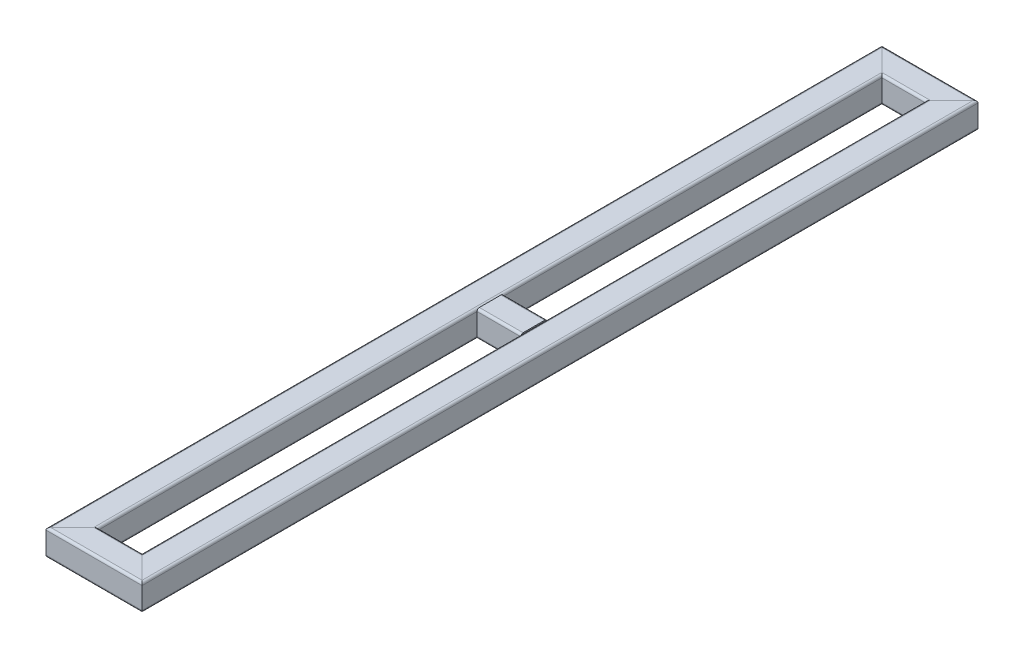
ISO-10303-21;
HEADER;
FILE_DESCRIPTION(('STEP AP214'),'2;1');
FILE_NAME('part.step','',(''),(''),'','','');
FILE_SCHEMA(('AUTOMOTIVE_DESIGN { 1 0 10303 214 1 1 1 1 }'));
ENDSEC;
DATA;
#1=APPLICATION_CONTEXT('core data for automotive mechanical design processes');
#2=APPLICATION_PROTOCOL_DEFINITION('international standard','automotive_design',2000,#1);
#3=PRODUCT_CONTEXT('',#1,'mechanical');
#4=PRODUCT('Part','Part','',(#3));
#5=PRODUCT_RELATED_PRODUCT_CATEGORY('part','',(#4));
#6=PRODUCT_DEFINITION_FORMATION('','',#4);
#7=PRODUCT_DEFINITION_CONTEXT('part definition',#1,'design');
#8=PRODUCT_DEFINITION('design','',#6,#7);
#9=PRODUCT_DEFINITION_SHAPE('','',#8);
#10=(LENGTH_UNIT() NAMED_UNIT(*) SI_UNIT(.MILLI.,.METRE.));
#11=(NAMED_UNIT(*) PLANE_ANGLE_UNIT() SI_UNIT($,.RADIAN.));
#12=(NAMED_UNIT(*) SI_UNIT($,.STERADIAN.) SOLID_ANGLE_UNIT());
#13=UNCERTAINTY_MEASURE_WITH_UNIT(LENGTH_MEASURE(1.E-05),#10,'distance_accuracy_value','');
#14=(GEOMETRIC_REPRESENTATION_CONTEXT(3) GLOBAL_UNCERTAINTY_ASSIGNED_CONTEXT((#13)) GLOBAL_UNIT_ASSIGNED_CONTEXT((#10,
#11,#12)) REPRESENTATION_CONTEXT('',''));
#15=CARTESIAN_POINT('',(0.,0.,0.));
#16=DIRECTION('',(0.,0.,1.));
#17=DIRECTION('',(1.,0.,0.));
#18=AXIS2_PLACEMENT_3D('',#15,#16,#17);
#19=CARTESIAN_POINT('',(18.5,18.5,0.));
#20=DIRECTION('',(0.,0.,-1.));
#21=DIRECTION('',(0.,1.,0.));
#22=AXIS2_PLACEMENT_3D('',#19,#20,#21);
#23=CYLINDRICAL_SURFACE('',#22,4.);
#24=CARTESIAN_POINT('',(18.5,18.4999999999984,-1371.5));
#25=DIRECTION('',(0.707106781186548,0.,-0.707106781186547));
#26=DIRECTION('',(-0.707106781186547,0.,-0.707106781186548));
#27=AXIS2_PLACEMENT_3D('',#24,#25,#26);
#28=ELLIPSE('',#27,5.65685424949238,4.);
#29=CARTESIAN_POINT('',(18.5,22.4999999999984,-1371.5));
#30=VERTEX_POINT('',#29);
#31=CARTESIAN_POINT('',(22.5,18.4999999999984,-1367.5));
#32=VERTEX_POINT('',#31);
#33=EDGE_CURVE('E215',#30,#32,#28,.T.);
#34=ORIENTED_EDGE('',*,*,#33,.F.);
#35=DIRECTION('',(0.,0.,-1.));
#36=VECTOR('',#35,1.);
#37=CARTESIAN_POINT('',(18.5,22.5,0.));
#38=LINE('',#37,#36);
#39=CARTESIAN_POINT('',(18.5,22.5,-18.4999999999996));
#40=VERTEX_POINT('',#39);
#41=EDGE_CURVE('E295',#40,#30,#38,.T.);
#42=ORIENTED_EDGE('',*,*,#41,.F.);
#43=CARTESIAN_POINT('',(18.5,18.5,-18.4999999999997));
#44=DIRECTION('',(0.707106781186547,0.,0.707106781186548));
#45=DIRECTION('',(0.707106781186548,0.,-0.707106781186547));
#46=AXIS2_PLACEMENT_3D('',#43,#44,#45);
#47=ELLIPSE('',#46,5.65685424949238,4.);
#48=CARTESIAN_POINT('',(22.5,18.5000000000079,-22.4999999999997));
#49=VERTEX_POINT('',#48);
#50=EDGE_CURVE('E206',#49,#40,#47,.T.);
#51=ORIENTED_EDGE('',*,*,#50,.F.);
#52=DIRECTION('',(0.,0.,-1.));
#53=VECTOR('',#52,1.);
#54=CARTESIAN_POINT('',(22.5,18.5,0.));
#55=LINE('',#54,#53);
#56=EDGE_CURVE('E75',#49,#32,#55,.T.);
#57=ORIENTED_EDGE('',*,*,#56,.T.);
#58=EDGE_LOOP('',(#34,#42,#51,#57));
#59=FACE_BOUND('',#58,.T.);
#60=ADVANCED_FACE('F71',(#59),#23,.T.);
#61=CARTESIAN_POINT('',(18.5,22.5,0.));
#62=DIRECTION('',(0.,-1.,0.));
#63=DIRECTION('',(0.,0.,-1.));
#64=AXIS2_PLACEMENT_3D('',#61,#62,#63);
#65=PLANE('',#64);
#66=DIRECTION('',(0.707106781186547,0.,0.707106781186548));
#67=VECTOR('',#66,1.);
#68=CARTESIAN_POINT('',(704.25,22.4999999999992,-685.749999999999));
#69=LINE('',#68,#67);
#70=CARTESIAN_POINT('',(-18.5,22.4999999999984,-1408.5));
#71=VERTEX_POINT('',#70);
#72=EDGE_CURVE('E212',#71,#30,#69,.T.);
#73=ORIENTED_EDGE('',*,*,#72,.F.);
#74=DIRECTION('',(0.,0.,-1.));
#75=VECTOR('',#74,1.);
#76=CARTESIAN_POINT('',(-18.5,22.5,0.));
#77=LINE('',#76,#75);
#78=CARTESIAN_POINT('',(-18.5,22.5,18.5000000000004));
#79=VERTEX_POINT('',#78);
#80=EDGE_CURVE('E293',#79,#71,#77,.T.);
#81=ORIENTED_EDGE('',*,*,#80,.F.);
#82=DIRECTION('',(-0.707106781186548,0.,0.707106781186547));
#83=VECTOR('',#82,1.);
#84=CARTESIAN_POINT('',(9.25000000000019,22.5,-9.24999999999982));
#85=LINE('',#84,#83);
#86=EDGE_CURVE('E311',#40,#79,#85,.T.);
#87=ORIENTED_EDGE('',*,*,#86,.F.);
#88=ORIENTED_EDGE('',*,*,#41,.T.);
#89=EDGE_LOOP('',(#73,#81,#87,#88));
#90=FACE_BOUND('',#89,.T.);
#91=ADVANCED_FACE('F302',(#90),#65,.F.);
#92=CARTESIAN_POINT('',(-18.5,18.5,0.));
#93=DIRECTION('',(0.,0.,-1.));
#94=DIRECTION('',(0.,1.,0.));
#95=AXIS2_PLACEMENT_3D('',#92,#93,#94);
#96=CYLINDRICAL_SURFACE('',#95,4.);
#97=CARTESIAN_POINT('',(-18.5,18.4999999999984,-1408.5));
#98=DIRECTION('',(0.707106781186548,0.,-0.707106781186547));
#99=DIRECTION('',(-0.707106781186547,0.,-0.707106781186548));
#100=AXIS2_PLACEMENT_3D('',#97,#98,#99);
#101=ELLIPSE('',#100,5.65685424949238,4.);
#102=CARTESIAN_POINT('',(-22.5,18.4999999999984,-1412.5));
#103=VERTEX_POINT('',#102);
#104=EDGE_CURVE('E13',#103,#71,#101,.T.);
#105=ORIENTED_EDGE('',*,*,#104,.F.);
#106=DIRECTION('',(0.,0.,-1.));
#107=VECTOR('',#106,1.);
#108=CARTESIAN_POINT('',(-22.5,18.5,0.));
#109=LINE('',#108,#107);
#110=CARTESIAN_POINT('',(-22.5,18.5,22.5));
#111=VERTEX_POINT('',#110);
#112=EDGE_CURVE('E290',#111,#103,#109,.T.);
#113=ORIENTED_EDGE('',*,*,#112,.F.);
#114=CARTESIAN_POINT('',(-18.5,18.5,18.5000000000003));
#115=DIRECTION('',(0.707106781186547,0.,0.707106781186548));
#116=DIRECTION('',(0.707106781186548,0.,-0.707106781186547));
#117=AXIS2_PLACEMENT_3D('',#114,#115,#116);
#118=ELLIPSE('',#117,5.65685424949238,4.);
#119=EDGE_CURVE('E308',#79,#111,#118,.T.);
#120=ORIENTED_EDGE('',*,*,#119,.F.);
#121=ORIENTED_EDGE('',*,*,#80,.T.);
#122=EDGE_LOOP('',(#105,#113,#120,#121));
#123=FACE_BOUND('',#122,.T.);
#124=ADVANCED_FACE('F305',(#123),#96,.T.);
#125=CARTESIAN_POINT('',(-22.5,-18.5,0.));
#126=DIRECTION('',(1.,0.,0.));
#127=DIRECTION('',(0.,0.,-1.));
#128=AXIS2_PLACEMENT_3D('',#125,#126,#127);
#129=PLANE('',#128);
#130=DIRECTION('',(0.,1.,0.));
#131=VECTOR('',#130,1.);
#132=CARTESIAN_POINT('',(-22.5,-18.4999999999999,-1412.5));
#133=LINE('',#132,#131);
#134=CARTESIAN_POINT('',(-22.5,-18.5000000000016,-1412.5));
#135=VERTEX_POINT('',#134);
#136=EDGE_CURVE('E81',#135,#103,#133,.T.);
#137=ORIENTED_EDGE('',*,*,#136,.F.);
#138=DIRECTION('',(0.,0.,-1.));
#139=VECTOR('',#138,1.);
#140=CARTESIAN_POINT('',(-22.5,-18.5,0.));
#141=LINE('',#140,#139);
#142=CARTESIAN_POINT('',(-22.5,-18.5,22.4999999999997));
#143=VERTEX_POINT('',#142);
#144=EDGE_CURVE('E287',#143,#135,#141,.T.);
#145=ORIENTED_EDGE('',*,*,#144,.F.);
#146=DIRECTION('',(0.,-1.,0.));
#147=VECTOR('',#146,1.);
#148=CARTESIAN_POINT('',(-22.5,-18.5000000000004,22.4999999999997));
#149=LINE('',#148,#147);
#150=EDGE_CURVE('E310',#111,#143,#149,.T.);
#151=ORIENTED_EDGE('',*,*,#150,.F.);
#152=ORIENTED_EDGE('',*,*,#112,.T.);
#153=EDGE_LOOP('',(#137,#145,#151,#152));
#154=FACE_BOUND('',#153,.T.);
#155=ADVANCED_FACE('F321',(#154),#129,.F.);
#156=CARTESIAN_POINT('',(-18.5,-18.5,0.));
#157=DIRECTION('',(0.,0.,-1.));
#158=DIRECTION('',(0.,1.,0.));
#159=AXIS2_PLACEMENT_3D('',#156,#157,#158);
#160=CYLINDRICAL_SURFACE('',#159,4.);
#161=CARTESIAN_POINT('',(-18.5,-18.5000000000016,-1408.5));
#162=DIRECTION('',(0.707106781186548,0.,-0.707106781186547));
#163=DIRECTION('',(-0.707106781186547,0.,-0.707106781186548));
#164=AXIS2_PLACEMENT_3D('',#161,#162,#163);
#165=ELLIPSE('',#164,5.65685424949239,4.);
#166=CARTESIAN_POINT('',(-18.5,-22.5000000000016,-1408.5));
#167=VERTEX_POINT('',#166);
#168=EDGE_CURVE('E230',#167,#135,#165,.T.);
#169=ORIENTED_EDGE('',*,*,#168,.F.);
#170=DIRECTION('',(0.,0.,-1.));
#171=VECTOR('',#170,1.);
#172=CARTESIAN_POINT('',(-18.5,-22.5,0.));
#173=LINE('',#172,#171);
#174=CARTESIAN_POINT('',(-18.5,-22.5,18.4999999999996));
#175=VERTEX_POINT('',#174);
#176=EDGE_CURVE('E284',#175,#167,#173,.T.);
#177=ORIENTED_EDGE('',*,*,#176,.F.);
#178=CARTESIAN_POINT('',(-18.5,-18.5,18.4999999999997));
#179=DIRECTION('',(0.707106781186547,0.,0.707106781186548));
#180=DIRECTION('',(0.707106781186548,0.,-0.707106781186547));
#181=AXIS2_PLACEMENT_3D('',#178,#179,#180);
#182=ELLIPSE('',#181,5.65685424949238,4.);
#183=EDGE_CURVE('E217',#143,#175,#182,.T.);
#184=ORIENTED_EDGE('',*,*,#183,.F.);
#185=ORIENTED_EDGE('',*,*,#144,.T.);
#186=EDGE_LOOP('',(#169,#177,#184,#185));
#187=FACE_BOUND('',#186,.T.);
#188=ADVANCED_FACE('F319',(#187),#160,.T.);
#189=CARTESIAN_POINT('',(-18.5,-22.5,0.));
#190=DIRECTION('',(0.,1.,0.));
#191=DIRECTION('',(0.,0.,1.));
#192=AXIS2_PLACEMENT_3D('',#189,#190,#191);
#193=PLANE('',#192);
#194=DIRECTION('',(-0.707106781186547,0.,-0.707106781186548));
#195=VECTOR('',#194,1.);
#196=CARTESIAN_POINT('',(685.75,-22.5000000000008,-704.249999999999));
#197=LINE('',#196,#195);
#198=CARTESIAN_POINT('',(18.5,-22.5000000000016,-1371.5));
#199=VERTEX_POINT('',#198);
#200=EDGE_CURVE('E233',#199,#167,#197,.T.);
#201=ORIENTED_EDGE('',*,*,#200,.F.);
#202=DIRECTION('',(0.,0.,-1.));
#203=VECTOR('',#202,1.);
#204=CARTESIAN_POINT('',(18.5,-22.5,0.));
#205=LINE('',#204,#203);
#206=CARTESIAN_POINT('',(18.5,-22.5,-18.5000000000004));
#207=VERTEX_POINT('',#206);
#208=EDGE_CURVE('E282',#207,#199,#205,.T.);
#209=ORIENTED_EDGE('',*,*,#208,.F.);
#210=DIRECTION('',(0.707106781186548,0.,-0.707106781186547));
#211=VECTOR('',#210,1.);
#212=CARTESIAN_POINT('',(-9.25000000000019,-22.5,9.24999999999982));
#213=LINE('',#212,#211);
#214=EDGE_CURVE('E211',#175,#207,#213,.T.);
#215=ORIENTED_EDGE('',*,*,#214,.F.);
#216=ORIENTED_EDGE('',*,*,#176,.T.);
#217=EDGE_LOOP('',(#201,#209,#215,#216));
#218=FACE_BOUND('',#217,.T.);
#219=ADVANCED_FACE('F323',(#218),#193,.F.);
#220=CARTESIAN_POINT('',(18.5,-18.5,0.));
#221=DIRECTION('',(0.,0.,-1.));
#222=DIRECTION('',(0.,1.,0.));
#223=AXIS2_PLACEMENT_3D('',#220,#221,#222);
#224=CYLINDRICAL_SURFACE('',#223,4.);
#225=CARTESIAN_POINT('',(18.5,-18.5000000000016,-1371.5));
#226=DIRECTION('',(0.707106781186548,0.,-0.707106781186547));
#227=DIRECTION('',(-0.707106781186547,0.,-0.707106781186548));
#228=AXIS2_PLACEMENT_3D('',#225,#226,#227);
#229=ELLIPSE('',#228,5.65685424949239,4.);
#230=CARTESIAN_POINT('',(22.5,-18.5000000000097,-1367.5));
#231=VERTEX_POINT('',#230);
#232=EDGE_CURVE('E194',#231,#199,#229,.T.);
#233=ORIENTED_EDGE('',*,*,#232,.F.);
#234=DIRECTION('',(0.,0.,-1.));
#235=VECTOR('',#234,1.);
#236=CARTESIAN_POINT('',(22.5,-18.5,0.));
#237=LINE('',#236,#235);
#238=CARTESIAN_POINT('',(22.5,-18.5,-22.5));
#239=VERTEX_POINT('',#238);
#240=EDGE_CURVE('E186',#239,#231,#237,.T.);
#241=ORIENTED_EDGE('',*,*,#240,.F.);
#242=CARTESIAN_POINT('',(18.5,-18.5,-18.5000000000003));
#243=DIRECTION('',(0.707106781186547,0.,0.707106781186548));
#244=DIRECTION('',(0.707106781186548,0.,-0.707106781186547));
#245=AXIS2_PLACEMENT_3D('',#242,#243,#244);
#246=ELLIPSE('',#245,5.65685424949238,4.);
#247=EDGE_CURVE('E191',#207,#239,#246,.T.);
#248=ORIENTED_EDGE('',*,*,#247,.F.);
#249=ORIENTED_EDGE('',*,*,#208,.T.);
#250=EDGE_LOOP('',(#233,#241,#248,#249));
#251=FACE_BOUND('',#250,.T.);
#252=ADVANCED_FACE('F188',(#251),#224,.T.);
#253=CARTESIAN_POINT('',(-18.5,18.5,0.));
#254=DIRECTION('',(0.,0.,-1.));
#255=DIRECTION('',(0.,1.,0.));
#256=AXIS2_PLACEMENT_3D('',#253,#254,#255);
#257=CYLINDRICAL_SURFACE('',#256,1.99999999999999);
#258=DIRECTION('',(0.,0.,-1.));
#259=VECTOR('',#258,1.);
#260=CARTESIAN_POINT('',(-20.5,18.5,0.));
#261=LINE('',#260,#259);
#262=CARTESIAN_POINT('',(-20.5,18.5000000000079,20.5000000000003));
#263=VERTEX_POINT('',#262);
#264=CARTESIAN_POINT('',(-20.5,18.4999999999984,-1410.5));
#265=VERTEX_POINT('',#264);
#266=EDGE_CURVE('E239',#263,#265,#261,.T.);
#267=ORIENTED_EDGE('',*,*,#266,.T.);
#268=CARTESIAN_POINT('',(-18.5,18.4999999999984,-1408.5));
#269=DIRECTION('',(0.707106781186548,0.,-0.707106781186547));
#270=DIRECTION('',(-0.707106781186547,0.,-0.707106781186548));
#271=AXIS2_PLACEMENT_3D('',#268,#269,#270);
#272=ELLIPSE('',#271,2.82842712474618,1.99999999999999);
#273=CARTESIAN_POINT('',(-18.5,20.4999999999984,-1408.5));
#274=VERTEX_POINT('',#273);
#275=EDGE_CURVE('E117',#265,#274,#272,.T.);
#276=ORIENTED_EDGE('',*,*,#275,.T.);
#277=DIRECTION('',(0.,0.,-1.));
#278=VECTOR('',#277,1.);
#279=CARTESIAN_POINT('',(-18.5,20.5,0.));
#280=LINE('',#279,#278);
#281=CARTESIAN_POINT('',(-18.5,20.5,18.5000000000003));
#282=VERTEX_POINT('',#281);
#283=EDGE_CURVE('E242',#282,#274,#280,.T.);
#284=ORIENTED_EDGE('',*,*,#283,.F.);
#285=CARTESIAN_POINT('',(-18.5,18.5,18.5000000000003));
#286=DIRECTION('',(0.707106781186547,0.,0.707106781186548));
#287=DIRECTION('',(0.707106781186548,0.,-0.707106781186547));
#288=AXIS2_PLACEMENT_3D('',#285,#286,#287);
#289=ELLIPSE('',#288,2.82842712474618,1.99999999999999);
#290=EDGE_CURVE('E238',#282,#263,#289,.T.);
#291=ORIENTED_EDGE('',*,*,#290,.T.);
#292=EDGE_LOOP('',(#267,#276,#284,#291));
#293=FACE_BOUND('',#292,.T.);
#294=ADVANCED_FACE('F330',(#293),#257,.F.);
#295=CARTESIAN_POINT('',(18.5,20.5,0.));
#296=DIRECTION('',(0.,-1.,0.));
#297=DIRECTION('',(0.,0.,-1.));
#298=AXIS2_PLACEMENT_3D('',#295,#296,#297);
#299=PLANE('',#298);
#300=ORIENTED_EDGE('',*,*,#283,.T.);
#301=DIRECTION('',(0.707106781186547,0.,0.707106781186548));
#302=VECTOR('',#301,1.);
#303=CARTESIAN_POINT('',(704.25,20.4999999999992,-685.749999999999));
#304=LINE('',#303,#302);
#305=CARTESIAN_POINT('',(18.5,20.4999999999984,-1371.5));
#306=VERTEX_POINT('',#305);
#307=EDGE_CURVE('E90',#274,#306,#304,.T.);
#308=ORIENTED_EDGE('',*,*,#307,.T.);
#309=DIRECTION('',(0.,0.,-1.));
#310=VECTOR('',#309,1.);
#311=CARTESIAN_POINT('',(18.5,20.5,0.));
#312=LINE('',#311,#310);
#313=CARTESIAN_POINT('',(18.5,20.5,-18.4999999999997));
#314=VERTEX_POINT('',#313);
#315=EDGE_CURVE('E247',#314,#306,#312,.T.);
#316=ORIENTED_EDGE('',*,*,#315,.F.);
#317=DIRECTION('',(-0.707106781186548,0.,0.707106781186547));
#318=VECTOR('',#317,1.);
#319=CARTESIAN_POINT('',(9.25000000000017,20.5,-9.24999999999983));
#320=LINE('',#319,#318);
#321=EDGE_CURVE('E241',#314,#282,#320,.T.);
#322=ORIENTED_EDGE('',*,*,#321,.T.);
#323=EDGE_LOOP('',(#300,#308,#316,#322));
#324=FACE_BOUND('',#323,.T.);
#325=ADVANCED_FACE('F372',(#324),#299,.T.);
#326=CARTESIAN_POINT('',(18.5,18.5,0.));
#327=DIRECTION('',(0.,0.,-1.));
#328=DIRECTION('',(0.,1.,0.));
#329=AXIS2_PLACEMENT_3D('',#326,#327,#328);
#330=CYLINDRICAL_SURFACE('',#329,1.99999999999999);
#331=ORIENTED_EDGE('',*,*,#315,.T.);
#332=CARTESIAN_POINT('',(18.5,18.4999999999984,-1371.5));
#333=DIRECTION('',(0.707106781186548,0.,-0.707106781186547));
#334=DIRECTION('',(-0.707106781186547,0.,-0.707106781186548));
#335=AXIS2_PLACEMENT_3D('',#332,#333,#334);
#336=ELLIPSE('',#335,2.82842712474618,1.99999999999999);
#337=CARTESIAN_POINT('',(20.5,18.5000000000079,-1369.5));
#338=VERTEX_POINT('',#337);
#339=EDGE_CURVE('E243',#306,#338,#336,.T.);
#340=ORIENTED_EDGE('',*,*,#339,.T.);
#341=DIRECTION('',(0.,0.,-1.));
#342=VECTOR('',#341,1.);
#343=CARTESIAN_POINT('',(20.5,18.5,0.));
#344=LINE('',#343,#342);
#345=CARTESIAN_POINT('',(20.5,18.5000000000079,-20.4999999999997));
#346=VERTEX_POINT('',#345);
#347=EDGE_CURVE('E252',#346,#338,#344,.T.);
#348=ORIENTED_EDGE('',*,*,#347,.F.);
#349=CARTESIAN_POINT('',(18.5,18.5,-18.4999999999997));
#350=DIRECTION('',(0.707106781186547,0.,0.707106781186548));
#351=DIRECTION('',(0.707106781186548,0.,-0.707106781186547));
#352=AXIS2_PLACEMENT_3D('',#349,#350,#351);
#353=ELLIPSE('',#352,2.82842712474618,1.99999999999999);
#354=EDGE_CURVE('E246',#346,#314,#353,.T.);
#355=ORIENTED_EDGE('',*,*,#354,.T.);
#356=EDGE_LOOP('',(#331,#340,#348,#355));
#357=FACE_BOUND('',#356,.T.);
#358=ADVANCED_FACE('F383',(#357),#330,.F.);
#359=CARTESIAN_POINT('',(20.5,18.5,0.));
#360=DIRECTION('',(-1.,0.,0.));
#361=DIRECTION('',(0.,0.,1.));
#362=AXIS2_PLACEMENT_3D('',#359,#360,#361);
#363=PLANE('',#362);
#364=ORIENTED_EDGE('',*,*,#347,.T.);
#365=DIRECTION('',(0.,-1.,0.));
#366=VECTOR('',#365,1.);
#367=CARTESIAN_POINT('',(20.5,18.5000000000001,-1369.5));
#368=LINE('',#367,#366);
#369=CARTESIAN_POINT('',(20.5,-18.5000000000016,-1369.5));
#370=VERTEX_POINT('',#369);
#371=EDGE_CURVE('E248',#338,#370,#368,.T.);
#372=ORIENTED_EDGE('',*,*,#371,.T.);
#373=DIRECTION('',(0.,0.,-1.));
#374=VECTOR('',#373,1.);
#375=CARTESIAN_POINT('',(20.5,-18.5,0.));
#376=LINE('',#375,#374);
#377=CARTESIAN_POINT('',(20.5,-18.5,-20.5000000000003));
#378=VERTEX_POINT('',#377);
#379=EDGE_CURVE('E257',#378,#370,#376,.T.);
#380=ORIENTED_EDGE('',*,*,#379,.F.);
#381=DIRECTION('',(0.,1.,0.));
#382=VECTOR('',#381,1.);
#383=CARTESIAN_POINT('',(20.5,18.5000000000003,-20.4999999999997));
#384=LINE('',#383,#382);
#385=EDGE_CURVE('E251',#378,#346,#384,.T.);
#386=ORIENTED_EDGE('',*,*,#385,.T.);
#387=EDGE_LOOP('',(#364,#372,#380,#386));
#388=FACE_BOUND('',#387,.T.);
#389=ADVANCED_FACE('F394',(#388),#363,.T.);
#390=CARTESIAN_POINT('',(18.5,-18.5,0.));
#391=DIRECTION('',(0.,0.,-1.));
#392=DIRECTION('',(0.,1.,0.));
#393=AXIS2_PLACEMENT_3D('',#390,#391,#392);
#394=CYLINDRICAL_SURFACE('',#393,2.);
#395=ORIENTED_EDGE('',*,*,#379,.T.);
#396=CARTESIAN_POINT('',(18.5,-18.5000000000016,-1371.5));
#397=DIRECTION('',(0.707106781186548,0.,-0.707106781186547));
#398=DIRECTION('',(-0.707106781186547,0.,-0.707106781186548));
#399=AXIS2_PLACEMENT_3D('',#396,#397,#398);
#400=ELLIPSE('',#399,2.82842712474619,2.);
#401=CARTESIAN_POINT('',(18.5000000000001,-20.5000000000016,-1371.5));
#402=VERTEX_POINT('',#401);
#403=EDGE_CURVE('E253',#370,#402,#400,.T.);
#404=ORIENTED_EDGE('',*,*,#403,.T.);
#405=DIRECTION('',(0.,0.,-1.));
#406=VECTOR('',#405,1.);
#407=CARTESIAN_POINT('',(18.5,-20.5,0.));
#408=LINE('',#407,#406);
#409=CARTESIAN_POINT('',(18.5,-20.5,-18.5000000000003));
#410=VERTEX_POINT('',#409);
#411=EDGE_CURVE('E262',#410,#402,#408,.T.);
#412=ORIENTED_EDGE('',*,*,#411,.F.);
#413=CARTESIAN_POINT('',(18.5,-18.5,-18.5000000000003));
#414=DIRECTION('',(0.707106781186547,0.,0.707106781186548));
#415=DIRECTION('',(0.707106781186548,0.,-0.707106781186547));
#416=AXIS2_PLACEMENT_3D('',#413,#414,#415);
#417=ELLIPSE('',#416,2.82842712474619,2.);
#418=EDGE_CURVE('E256',#410,#378,#417,.T.);
#419=ORIENTED_EDGE('',*,*,#418,.T.);
#420=EDGE_LOOP('',(#395,#404,#412,#419));
#421=FACE_BOUND('',#420,.T.);
#422=ADVANCED_FACE('F405',(#421),#394,.F.);
#423=CARTESIAN_POINT('',(-18.5,-20.5,0.));
#424=DIRECTION('',(0.,1.,0.));
#425=DIRECTION('',(0.,0.,1.));
#426=AXIS2_PLACEMENT_3D('',#423,#424,#425);
#427=PLANE('',#426);
#428=ORIENTED_EDGE('',*,*,#411,.T.);
#429=DIRECTION('',(-0.707106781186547,0.,-0.707106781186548));
#430=VECTOR('',#429,1.);
#431=CARTESIAN_POINT('',(685.75,-20.5000000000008,-704.249999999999));
#432=LINE('',#431,#430);
#433=CARTESIAN_POINT('',(-18.5,-20.5000000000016,-1408.5));
#434=VERTEX_POINT('',#433);
#435=EDGE_CURVE('E258',#402,#434,#432,.T.);
#436=ORIENTED_EDGE('',*,*,#435,.T.);
#437=DIRECTION('',(0.,0.,-1.));
#438=VECTOR('',#437,1.);
#439=CARTESIAN_POINT('',(-18.5,-20.5,0.));
#440=LINE('',#439,#438);
#441=CARTESIAN_POINT('',(-18.5,-20.5,18.4999999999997));
#442=VERTEX_POINT('',#441);
#443=EDGE_CURVE('E266',#442,#434,#440,.T.);
#444=ORIENTED_EDGE('',*,*,#443,.F.);
#445=DIRECTION('',(0.707106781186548,0.,-0.707106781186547));
#446=VECTOR('',#445,1.);
#447=CARTESIAN_POINT('',(-9.25000000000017,-20.5,9.24999999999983));
#448=LINE('',#447,#446);
#449=EDGE_CURVE('E261',#442,#410,#448,.T.);
#450=ORIENTED_EDGE('',*,*,#449,.T.);
#451=EDGE_LOOP('',(#428,#436,#444,#450));
#452=FACE_BOUND('',#451,.T.);
#453=ADVANCED_FACE('F416',(#452),#427,.T.);
#454=CARTESIAN_POINT('',(-18.5,-18.5,0.));
#455=DIRECTION('',(0.,0.,-1.));
#456=DIRECTION('',(0.,1.,0.));
#457=AXIS2_PLACEMENT_3D('',#454,#455,#456);
#458=CYLINDRICAL_SURFACE('',#457,2.);
#459=ORIENTED_EDGE('',*,*,#443,.T.);
#460=CARTESIAN_POINT('',(-18.5,-18.5000000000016,-1408.5));
#461=DIRECTION('',(0.707106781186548,0.,-0.707106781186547));
#462=DIRECTION('',(-0.707106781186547,0.,-0.707106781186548));
#463=AXIS2_PLACEMENT_3D('',#460,#461,#462);
#464=ELLIPSE('',#463,2.82842712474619,2.);
#465=CARTESIAN_POINT('',(-20.5,-18.5000000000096,-1410.5));
#466=VERTEX_POINT('',#465);
#467=EDGE_CURVE('E263',#434,#466,#464,.T.);
#468=ORIENTED_EDGE('',*,*,#467,.T.);
#469=DIRECTION('',(0.,0.,-1.));
#470=VECTOR('',#469,1.);
#471=CARTESIAN_POINT('',(-20.5,-18.5,0.));
#472=LINE('',#471,#470);
#473=CARTESIAN_POINT('',(-20.5,-18.5,20.5));
#474=VERTEX_POINT('',#473);
#475=EDGE_CURVE('E224',#474,#466,#472,.T.);
#476=ORIENTED_EDGE('',*,*,#475,.F.);
#477=CARTESIAN_POINT('',(-18.5,-18.5,18.4999999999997));
#478=DIRECTION('',(0.707106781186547,0.,0.707106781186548));
#479=DIRECTION('',(0.707106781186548,0.,-0.707106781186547));
#480=AXIS2_PLACEMENT_3D('',#477,#478,#479);
#481=ELLIPSE('',#480,2.82842712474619,2.);
#482=EDGE_CURVE('E265',#474,#442,#481,.T.);
#483=ORIENTED_EDGE('',*,*,#482,.T.);
#484=EDGE_LOOP('',(#459,#468,#476,#483));
#485=FACE_BOUND('',#484,.T.);
#486=ADVANCED_FACE('F427',(#485),#458,.F.);
#487=CARTESIAN_POINT('',(-20.5,-18.5,0.));
#488=DIRECTION('',(1.,0.,0.));
#489=DIRECTION('',(0.,0.,-1.));
#490=AXIS2_PLACEMENT_3D('',#487,#488,#489);
#491=PLANE('',#490);
#492=ORIENTED_EDGE('',*,*,#475,.T.);
#493=DIRECTION('',(0.,1.,0.));
#494=VECTOR('',#493,1.);
#495=CARTESIAN_POINT('',(-20.5,-18.4999999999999,-1410.5));
#496=LINE('',#495,#494);
#497=EDGE_CURVE('E112',#466,#265,#496,.T.);
#498=ORIENTED_EDGE('',*,*,#497,.T.);
#499=ORIENTED_EDGE('',*,*,#266,.F.);
#500=DIRECTION('',(0.,-1.,0.));
#501=VECTOR('',#500,1.);
#502=CARTESIAN_POINT('',(-20.5,-18.5000000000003,20.4999999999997));
#503=LINE('',#502,#501);
#504=EDGE_CURVE('E199',#263,#474,#503,.T.);
#505=ORIENTED_EDGE('',*,*,#504,.T.);
#506=EDGE_LOOP('',(#492,#498,#499,#505));
#507=FACE_BOUND('',#506,.T.);
#508=ADVANCED_FACE('F438',(#507),#491,.T.);
#509=CARTESIAN_POINT('',(22.5,18.5,0.));
#510=DIRECTION('',(-1.,0.,0.));
#511=DIRECTION('',(0.,0.,1.));
#512=AXIS2_PLACEMENT_3D('',#509,#510,#511);
#513=PLANE('',#512);
#514=DIRECTION('',(0.,-1.,0.));
#515=VECTOR('',#514,1.);
#516=CARTESIAN_POINT('',(22.5,18.5000000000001,-1367.5));
#517=LINE('',#516,#515);
#518=EDGE_CURVE('E226',#32,#231,#517,.T.);
#519=ORIENTED_EDGE('',*,*,#518,.F.);
#520=ORIENTED_EDGE('',*,*,#56,.F.);
#521=DIRECTION('',(0.,1.,0.));
#522=VECTOR('',#521,1.);
#523=CARTESIAN_POINT('',(22.5,18.5000000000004,-22.4999999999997));
#524=LINE('',#523,#522);
#525=EDGE_CURVE('E198',#239,#49,#524,.T.);
#526=ORIENTED_EDGE('',*,*,#525,.F.);
#527=ORIENTED_EDGE('',*,*,#240,.T.);
#528=EDGE_LOOP('',(#519,#520,#526,#527));
#529=FACE_BOUND('',#528,.T.);
#530=ADVANCED_FACE('F202',(#529),#513,.F.);
#531=CARTESIAN_POINT('',(0.,0.,0.));
#532=DIRECTION('',(0.707106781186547,0.,0.707106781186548));
#533=DIRECTION('',(0.707106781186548,0.,-0.707106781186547));
#534=AXIS2_PLACEMENT_3D('',#531,#532,#533);
#535=PLANE('',#534);
#536=ORIENTED_EDGE('',*,*,#290,.F.);
#537=ORIENTED_EDGE('',*,*,#321,.F.);
#538=ORIENTED_EDGE('',*,*,#354,.F.);
#539=ORIENTED_EDGE('',*,*,#385,.F.);
#540=ORIENTED_EDGE('',*,*,#418,.F.);
#541=ORIENTED_EDGE('',*,*,#449,.F.);
#542=ORIENTED_EDGE('',*,*,#482,.F.);
#543=ORIENTED_EDGE('',*,*,#504,.F.);
#544=EDGE_LOOP('',(#536,#537,#538,#539,#540,#541,#542,#543));
#545=FACE_BOUND('',#544,.T.);
#546=ORIENTED_EDGE('',*,*,#525,.T.);
#547=ORIENTED_EDGE('',*,*,#50,.T.);
#548=ORIENTED_EDGE('',*,*,#86,.T.);
#549=ORIENTED_EDGE('',*,*,#119,.T.);
#550=ORIENTED_EDGE('',*,*,#150,.T.);
#551=ORIENTED_EDGE('',*,*,#183,.T.);
#552=ORIENTED_EDGE('',*,*,#214,.T.);
#553=ORIENTED_EDGE('',*,*,#247,.T.);
#554=EDGE_LOOP('',(#546,#547,#548,#549,#550,#551,#552,#553));
#555=FACE_BOUND('',#554,.T.);
#556=ADVANCED_FACE('F209',(#545,#555),#535,.T.);
#557=CARTESIAN_POINT('',(0.,-1.58528700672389E-12,-1390.));
#558=DIRECTION('',(0.707106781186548,0.,-0.707106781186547));
#559=DIRECTION('',(-0.707106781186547,0.,-0.707106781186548));
#560=AXIS2_PLACEMENT_3D('',#557,#558,#559);
#561=PLANE('',#560);
#562=ORIENTED_EDGE('',*,*,#275,.F.);
#563=ORIENTED_EDGE('',*,*,#497,.F.);
#564=ORIENTED_EDGE('',*,*,#467,.F.);
#565=ORIENTED_EDGE('',*,*,#435,.F.);
#566=ORIENTED_EDGE('',*,*,#403,.F.);
#567=ORIENTED_EDGE('',*,*,#371,.F.);
#568=ORIENTED_EDGE('',*,*,#339,.F.);
#569=ORIENTED_EDGE('',*,*,#307,.F.);
#570=EDGE_LOOP('',(#562,#563,#564,#565,#566,#567,#568,#569));
#571=FACE_BOUND('',#570,.T.);
#572=ORIENTED_EDGE('',*,*,#72,.T.);
#573=ORIENTED_EDGE('',*,*,#33,.T.);
#574=ORIENTED_EDGE('',*,*,#518,.T.);
#575=ORIENTED_EDGE('',*,*,#232,.T.);
#576=ORIENTED_EDGE('',*,*,#200,.T.);
#577=ORIENTED_EDGE('',*,*,#168,.T.);
#578=ORIENTED_EDGE('',*,*,#136,.T.);
#579=ORIENTED_EDGE('',*,*,#104,.T.);
#580=EDGE_LOOP('',(#572,#573,#574,#575,#576,#577,#578,#579));
#581=FACE_BOUND('',#580,.T.);
#582=ADVANCED_FACE('F73',(#571,#581),#561,.T.);
#583=CLOSED_SHELL('',(#60,#91,#124,#155,#188,#219,#252,#294,#325,#358,#389,#422,#453,#486,#508,
#530,#556,#582));
#584=MANIFOLD_SOLID_BREP('B2',#583);
#585=CARTESIAN_POINT('',(1.11022302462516E-13,18.4999999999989,-1371.5));
#586=DIRECTION('',(1.,0.,0.));
#587=DIRECTION('',(0.,0.,-1.));
#588=AXIS2_PLACEMENT_3D('',#585,#586,#587);
#589=CYLINDRICAL_SURFACE('',#588,4.);
#590=CARTESIAN_POINT('',(18.4999999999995,18.4999999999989,-1371.5));
#591=DIRECTION('',(-0.707106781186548,0.,0.707106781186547));
#592=DIRECTION('',(0.707106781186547,0.,0.707106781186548));
#593=AXIS2_PLACEMENT_3D('',#590,#591,#592);
#594=ELLIPSE('',#593,5.65685424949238,4.);
#595=CARTESIAN_POINT('',(22.4999999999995,18.4999999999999,-1367.5));
#596=VERTEX_POINT('',#595);
#597=CARTESIAN_POINT('',(18.4999999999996,22.4999999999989,-1371.5));
#598=VERTEX_POINT('',#597);
#599=EDGE_CURVE('E695',#596,#598,#594,.T.);
#600=ORIENTED_EDGE('',*,*,#599,.F.);
#601=DIRECTION('',(1.,0.,0.));
#602=VECTOR('',#601,1.);
#603=CARTESIAN_POINT('',(1.11022302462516E-13,18.499999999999,-1367.5));
#604=LINE('',#603,#602);
#605=CARTESIAN_POINT('',(97.4999999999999,18.4999999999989,-1367.5));
#606=VERTEX_POINT('',#605);
#607=EDGE_CURVE('E571',#596,#606,#604,.T.);
#608=ORIENTED_EDGE('',*,*,#607,.T.);
#609=CARTESIAN_POINT('',(101.5,18.4999999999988,-1371.5));
#610=DIRECTION('',(0.707106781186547,0.,0.707106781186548));
#611=DIRECTION('',(0.707106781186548,0.,-0.707106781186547));
#612=AXIS2_PLACEMENT_3D('',#609,#610,#611);
#613=ELLIPSE('',#612,5.65685424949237,4.);
#614=CARTESIAN_POINT('',(101.5,22.4999999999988,-1371.5));
#615=VERTEX_POINT('',#614);
#616=EDGE_CURVE('E776',#615,#606,#613,.T.);
#617=ORIENTED_EDGE('',*,*,#616,.F.);
#618=DIRECTION('',(1.,0.,0.));
#619=VECTOR('',#618,1.);
#620=CARTESIAN_POINT('',(1.11022302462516E-13,22.4999999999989,-1371.5));
#621=LINE('',#620,#619);
#622=EDGE_CURVE('E769',#598,#615,#621,.T.);
#623=ORIENTED_EDGE('',*,*,#622,.F.);
#624=EDGE_LOOP('',(#600,#608,#617,#623));
#625=FACE_BOUND('',#624,.T.);
#626=ADVANCED_FACE('F567',(#625),#589,.T.);
#627=CARTESIAN_POINT('',(1.11022302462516E-13,22.4999999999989,-1371.5));
#628=DIRECTION('',(0.,-1.,0.));
#629=DIRECTION('',(0.,0.,-1.));
#630=AXIS2_PLACEMENT_3D('',#627,#628,#629);
#631=PLANE('',#630);
#632=DIRECTION('',(-0.707106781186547,0.,-0.707106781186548));
#633=VECTOR('',#632,1.);
#634=CARTESIAN_POINT('',(9.24999999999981,22.4999999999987,-1380.75));
#635=LINE('',#634,#633);
#636=CARTESIAN_POINT('',(-18.5000000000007,22.4999999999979,-1408.5));
#637=VERTEX_POINT('',#636);
#638=EDGE_CURVE('E713',#598,#637,#635,.T.);
#639=ORIENTED_EDGE('',*,*,#638,.F.);
#640=ORIENTED_EDGE('',*,*,#622,.T.);
#641=DIRECTION('',(-0.707106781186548,0.,0.707106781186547));
#642=VECTOR('',#641,1.);
#643=CARTESIAN_POINT('',(50.7500000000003,22.5000000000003,-1320.75));
#644=LINE('',#643,#642);
#645=CARTESIAN_POINT('',(138.500000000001,22.4999999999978,-1408.5));
#646=VERTEX_POINT('',#645);
#647=EDGE_CURVE('E685',#646,#615,#644,.T.);
#648=ORIENTED_EDGE('',*,*,#647,.F.);
#649=DIRECTION('',(1.,0.,0.));
#650=VECTOR('',#649,1.);
#651=CARTESIAN_POINT('',(1.11022302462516E-13,22.4999999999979,-1408.5));
#652=LINE('',#651,#650);
#653=EDGE_CURVE('E768',#637,#646,#652,.T.);
#654=ORIENTED_EDGE('',*,*,#653,.F.);
#655=EDGE_LOOP('',(#639,#640,#648,#654));
#656=FACE_BOUND('',#655,.T.);
#657=ADVANCED_FACE('F823',(#656),#631,.F.);
#658=CARTESIAN_POINT('',(1.11022302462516E-13,18.4999999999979,-1408.5));
#659=DIRECTION('',(1.,0.,0.));
#660=DIRECTION('',(0.,0.,-1.));
#661=AXIS2_PLACEMENT_3D('',#658,#659,#660);
#662=CYLINDRICAL_SURFACE('',#661,4.);
#663=CARTESIAN_POINT('',(-18.5000000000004,18.4999999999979,-1408.5));
#664=DIRECTION('',(-0.707106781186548,0.,0.707106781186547));
#665=DIRECTION('',(0.707106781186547,0.,0.707106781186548));
#666=AXIS2_PLACEMENT_3D('',#663,#664,#665);
#667=ELLIPSE('',#666,5.65685424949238,4.);
#668=CARTESIAN_POINT('',(-22.5,18.4999999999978,-1412.5));
#669=VERTEX_POINT('',#668);
#670=EDGE_CURVE('E710',#637,#669,#667,.T.);
#671=ORIENTED_EDGE('',*,*,#670,.F.);
#672=ORIENTED_EDGE('',*,*,#653,.T.);
#673=CARTESIAN_POINT('',(138.5,18.4999999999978,-1408.5));
#674=DIRECTION('',(0.707106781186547,0.,0.707106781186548));
#675=DIRECTION('',(0.707106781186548,0.,-0.707106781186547));
#676=AXIS2_PLACEMENT_3D('',#673,#674,#675);
#677=ELLIPSE('',#676,5.65685424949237,4.);
#678=CARTESIAN_POINT('',(142.5,18.4999999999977,-1412.5));
#679=VERTEX_POINT('',#678);
#680=EDGE_CURVE('E696',#679,#646,#677,.T.);
#681=ORIENTED_EDGE('',*,*,#680,.F.);
#682=DIRECTION('',(1.,0.,0.));
#683=VECTOR('',#682,1.);
#684=CARTESIAN_POINT('',(1.11022302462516E-13,18.4999999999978,-1412.5));
#685=LINE('',#684,#683);
#686=EDGE_CURVE('E766',#669,#679,#685,.T.);
#687=ORIENTED_EDGE('',*,*,#686,.F.);
#688=EDGE_LOOP('',(#671,#672,#681,#687));
#689=FACE_BOUND('',#688,.T.);
#690=ADVANCED_FACE('F821',(#689),#662,.T.);
#691=CARTESIAN_POINT('',(1.11022302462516E-13,-18.5000000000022,-1412.5));
#692=DIRECTION('',(0.,0.,1.));
#693=DIRECTION('',(0.,-1.,0.));
#694=AXIS2_PLACEMENT_3D('',#691,#692,#693);
#695=PLANE('',#694);
#696=DIRECTION('',(0.,-1.,0.));
#697=VECTOR('',#696,1.);
#698=CARTESIAN_POINT('',(-22.4999999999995,-18.5000000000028,-1412.5));
#699=LINE('',#698,#697);
#700=CARTESIAN_POINT('',(-22.4999999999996,-18.5000000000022,-1412.5));
#701=VERTEX_POINT('',#700);
#702=EDGE_CURVE('E705',#669,#701,#699,.T.);
#703=ORIENTED_EDGE('',*,*,#702,.F.);
#704=ORIENTED_EDGE('',*,*,#686,.T.);
#705=DIRECTION('',(0.,1.,0.));
#706=VECTOR('',#705,1.);
#707=CARTESIAN_POINT('',(142.5,-18.500000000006,-1412.5));
#708=LINE('',#707,#706);
#709=CARTESIAN_POINT('',(142.499999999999,-18.5000000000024,-1412.5));
#710=VERTEX_POINT('',#709);
#711=EDGE_CURVE('E815',#710,#679,#708,.T.);
#712=ORIENTED_EDGE('',*,*,#711,.F.);
#713=DIRECTION('',(1.,0.,0.));
#714=VECTOR('',#713,1.);
#715=CARTESIAN_POINT('',(1.11022302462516E-13,-18.5000000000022,-1412.5));
#716=LINE('',#715,#714);
#717=EDGE_CURVE('E764',#701,#710,#716,.T.);
#718=ORIENTED_EDGE('',*,*,#717,.F.);
#719=EDGE_LOOP('',(#703,#704,#712,#718));
#720=FACE_BOUND('',#719,.T.);
#721=ADVANCED_FACE('F830',(#720),#695,.F.);
#722=CARTESIAN_POINT('',(1.11022302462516E-13,-18.5000000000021,-1408.5));
#723=DIRECTION('',(1.,0.,0.));
#724=DIRECTION('',(0.,0.,-1.));
#725=AXIS2_PLACEMENT_3D('',#722,#723,#724);
#726=CYLINDRICAL_SURFACE('',#725,4.);
#727=CARTESIAN_POINT('',(-18.4999999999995,-18.5000000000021,-1408.5));
#728=DIRECTION('',(-0.707106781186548,0.,0.707106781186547));
#729=DIRECTION('',(0.707106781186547,0.,0.707106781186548));
#730=AXIS2_PLACEMENT_3D('',#727,#728,#729);
#731=ELLIPSE('',#730,5.65685424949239,4.);
#732=CARTESIAN_POINT('',(-18.4999999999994,-22.5000000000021,-1408.5));
#733=VERTEX_POINT('',#732);
#734=EDGE_CURVE('E701',#701,#733,#731,.T.);
#735=ORIENTED_EDGE('',*,*,#734,.F.);
#736=ORIENTED_EDGE('',*,*,#717,.T.);
#737=CARTESIAN_POINT('',(138.5,-18.5000000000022,-1408.5));
#738=DIRECTION('',(0.707106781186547,0.,0.707106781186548));
#739=DIRECTION('',(0.707106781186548,0.,-0.707106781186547));
#740=AXIS2_PLACEMENT_3D('',#737,#738,#739);
#741=ELLIPSE('',#740,5.65685424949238,4.);
#742=CARTESIAN_POINT('',(138.499999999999,-22.5000000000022,-1408.5));
#743=VERTEX_POINT('',#742);
#744=EDGE_CURVE('E812',#743,#710,#741,.T.);
#745=ORIENTED_EDGE('',*,*,#744,.F.);
#746=DIRECTION('',(1.,0.,0.));
#747=VECTOR('',#746,1.);
#748=CARTESIAN_POINT('',(1.11022302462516E-13,-22.5000000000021,-1408.5));
#749=LINE('',#748,#747);
#750=EDGE_CURVE('E762',#733,#743,#749,.T.);
#751=ORIENTED_EDGE('',*,*,#750,.F.);
#752=EDGE_LOOP('',(#735,#736,#745,#751));
#753=FACE_BOUND('',#752,.T.);
#754=ADVANCED_FACE('F835',(#753),#726,.T.);
#755=CARTESIAN_POINT('',(1.11022302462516E-13,-22.5000000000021,-1408.5));
#756=DIRECTION('',(0.,1.,0.));
#757=DIRECTION('',(0.,0.,1.));
#758=AXIS2_PLACEMENT_3D('',#755,#756,#757);
#759=PLANE('',#758);
#760=DIRECTION('',(0.707106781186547,0.,0.707106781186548));
#761=VECTOR('',#760,1.);
#762=CARTESIAN_POINT('',(-9.24999999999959,-22.5000000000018,-1399.25));
#763=LINE('',#762,#761);
#764=CARTESIAN_POINT('',(18.5000000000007,-22.5000000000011,-1371.5));
#765=VERTEX_POINT('',#764);
#766=EDGE_CURVE('E577',#733,#765,#763,.T.);
#767=ORIENTED_EDGE('',*,*,#766,.F.);
#768=ORIENTED_EDGE('',*,*,#750,.T.);
#769=DIRECTION('',(0.707106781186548,0.,-0.707106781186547));
#770=VECTOR('',#769,1.);
#771=CARTESIAN_POINT('',(69.2499999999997,-22.5000000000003,-1339.25));
#772=LINE('',#771,#770);
#773=CARTESIAN_POINT('',(101.499999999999,-22.5000000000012,-1371.5));
#774=VERTEX_POINT('',#773);
#775=EDGE_CURVE('E809',#774,#743,#772,.T.);
#776=ORIENTED_EDGE('',*,*,#775,.F.);
#777=DIRECTION('',(1.,0.,0.));
#778=VECTOR('',#777,1.);
#779=CARTESIAN_POINT('',(1.11022302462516E-13,-22.5000000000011,-1371.5));
#780=LINE('',#779,#778);
#781=EDGE_CURVE('E720',#765,#774,#780,.T.);
#782=ORIENTED_EDGE('',*,*,#781,.F.);
#783=EDGE_LOOP('',(#767,#768,#776,#782));
#784=FACE_BOUND('',#783,.T.);
#785=ADVANCED_FACE('F839',(#784),#759,.F.);
#786=CARTESIAN_POINT('',(1.11022302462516E-13,-18.5000000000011,-1371.5));
#787=DIRECTION('',(1.,0.,0.));
#788=DIRECTION('',(0.,0.,-1.));
#789=AXIS2_PLACEMENT_3D('',#786,#787,#788);
#790=CYLINDRICAL_SURFACE('',#789,4.);
#791=CARTESIAN_POINT('',(18.5000000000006,-18.5000000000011,-1371.5));
#792=DIRECTION('',(-0.707106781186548,0.,0.707106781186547));
#793=DIRECTION('',(0.707106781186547,0.,0.707106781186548));
#794=AXIS2_PLACEMENT_3D('',#791,#792,#793);
#795=ELLIPSE('',#794,5.65685424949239,4.);
#796=CARTESIAN_POINT('',(22.5,-18.500000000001,-1367.5));
#797=VERTEX_POINT('',#796);
#798=EDGE_CURVE('E69',#765,#797,#795,.T.);
#799=ORIENTED_EDGE('',*,*,#798,.F.);
#800=ORIENTED_EDGE('',*,*,#781,.T.);
#801=CARTESIAN_POINT('',(101.499999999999,-18.5000000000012,-1371.5));
#802=DIRECTION('',(0.707106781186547,0.,0.707106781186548));
#803=DIRECTION('',(0.707106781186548,0.,-0.707106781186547));
#804=AXIS2_PLACEMENT_3D('',#801,#802,#803);
#805=ELLIPSE('',#804,5.65685424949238,4.);
#806=CARTESIAN_POINT('',(97.4999999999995,-18.5000000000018,-1367.5));
#807=VERTEX_POINT('',#806);
#808=EDGE_CURVE('E681',#807,#774,#805,.T.);
#809=ORIENTED_EDGE('',*,*,#808,.F.);
#810=DIRECTION('',(1.,0.,0.));
#811=VECTOR('',#810,1.);
#812=CARTESIAN_POINT('',(1.11022302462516E-13,-18.500000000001,-1367.5));
#813=LINE('',#812,#811);
#814=EDGE_CURVE('E676',#797,#807,#813,.T.);
#815=ORIENTED_EDGE('',*,*,#814,.F.);
#816=EDGE_LOOP('',(#799,#800,#809,#815));
#817=FACE_BOUND('',#816,.T.);
#818=ADVANCED_FACE('F678',(#817),#790,.T.);
#819=CARTESIAN_POINT('',(1.11022302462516E-13,18.4999999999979,-1408.5));
#820=DIRECTION('',(1.,0.,0.));
#821=DIRECTION('',(0.,0.,-1.));
#822=AXIS2_PLACEMENT_3D('',#819,#820,#821);
#823=CYLINDRICAL_SURFACE('',#822,1.99999999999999);
#824=DIRECTION('',(1.,0.,0.));
#825=VECTOR('',#824,1.);
#826=CARTESIAN_POINT('',(1.11022302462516E-13,20.4999999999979,-1408.5));
#827=LINE('',#826,#825);
#828=CARTESIAN_POINT('',(-18.5000000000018,20.4999999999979,-1408.5));
#829=VERTEX_POINT('',#828);
#830=CARTESIAN_POINT('',(138.500000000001,20.4999999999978,-1408.5));
#831=VERTEX_POINT('',#830);
#832=EDGE_CURVE('E724',#829,#831,#827,.T.);
#833=ORIENTED_EDGE('',*,*,#832,.F.);
#834=CARTESIAN_POINT('',(-18.5000000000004,18.4999999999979,-1408.5));
#835=DIRECTION('',(-0.707106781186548,0.,0.707106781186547));
#836=DIRECTION('',(0.707106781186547,0.,0.707106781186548));
#837=AXIS2_PLACEMENT_3D('',#834,#835,#836);
#838=ELLIPSE('',#837,2.82842712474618,1.99999999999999);
#839=CARTESIAN_POINT('',(-20.5000000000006,18.4999999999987,-1410.5));
#840=VERTEX_POINT('',#839);
#841=EDGE_CURVE('E717',#829,#840,#838,.T.);
#842=ORIENTED_EDGE('',*,*,#841,.T.);
#843=DIRECTION('',(1.,0.,0.));
#844=VECTOR('',#843,1.);
#845=CARTESIAN_POINT('',(1.11022302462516E-13,18.4999999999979,-1410.5));
#846=LINE('',#845,#844);
#847=CARTESIAN_POINT('',(140.5,18.4999999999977,-1410.5));
#848=VERTEX_POINT('',#847);
#849=EDGE_CURVE('E719',#840,#848,#846,.T.);
#850=ORIENTED_EDGE('',*,*,#849,.T.);
#851=CARTESIAN_POINT('',(138.5,18.4999999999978,-1408.5));
#852=DIRECTION('',(0.707106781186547,0.,0.707106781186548));
#853=DIRECTION('',(0.707106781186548,0.,-0.707106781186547));
#854=AXIS2_PLACEMENT_3D('',#851,#852,#853);
#855=ELLIPSE('',#854,2.82842712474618,1.99999999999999);
#856=EDGE_CURVE('E725',#848,#831,#855,.T.);
#857=ORIENTED_EDGE('',*,*,#856,.T.);
#858=EDGE_LOOP('',(#833,#842,#850,#857));
#859=FACE_BOUND('',#858,.T.);
#860=ADVANCED_FACE('F845',(#859),#823,.F.);
#861=CARTESIAN_POINT('',(1.11022302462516E-13,20.4999999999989,-1371.5));
#862=DIRECTION('',(0.,-1.,0.));
#863=DIRECTION('',(0.,0.,-1.));
#864=AXIS2_PLACEMENT_3D('',#861,#862,#863);
#865=PLANE('',#864);
#866=DIRECTION('',(1.,0.,0.));
#867=VECTOR('',#866,1.);
#868=CARTESIAN_POINT('',(1.11022302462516E-13,20.4999999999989,-1371.5));
#869=LINE('',#868,#867);
#870=CARTESIAN_POINT('',(18.4999999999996,20.4999999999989,-1371.5));
#871=VERTEX_POINT('',#870);
#872=CARTESIAN_POINT('',(101.5,20.4999999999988,-1371.5));
#873=VERTEX_POINT('',#872);
#874=EDGE_CURVE('E729',#871,#873,#869,.T.);
#875=ORIENTED_EDGE('',*,*,#874,.F.);
#876=DIRECTION('',(-0.707106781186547,0.,-0.707106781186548));
#877=VECTOR('',#876,1.);
#878=CARTESIAN_POINT('',(9.24999999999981,20.4999999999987,-1380.75));
#879=LINE('',#878,#877);
#880=EDGE_CURVE('E721',#871,#829,#879,.T.);
#881=ORIENTED_EDGE('',*,*,#880,.T.);
#882=ORIENTED_EDGE('',*,*,#832,.T.);
#883=DIRECTION('',(-0.707106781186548,0.,0.707106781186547));
#884=VECTOR('',#883,1.);
#885=CARTESIAN_POINT('',(50.7500000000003,20.5000000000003,-1320.75));
#886=LINE('',#885,#884);
#887=EDGE_CURVE('E730',#831,#873,#886,.T.);
#888=ORIENTED_EDGE('',*,*,#887,.T.);
#889=EDGE_LOOP('',(#875,#881,#882,#888));
#890=FACE_BOUND('',#889,.T.);
#891=ADVANCED_FACE('F851',(#890),#865,.T.);
#892=CARTESIAN_POINT('',(1.11022302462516E-13,18.4999999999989,-1371.5));
#893=DIRECTION('',(1.,0.,0.));
#894=DIRECTION('',(0.,0.,-1.));
#895=AXIS2_PLACEMENT_3D('',#892,#893,#894);
#896=CYLINDRICAL_SURFACE('',#895,1.99999999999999);
#897=DIRECTION('',(1.,0.,0.));
#898=VECTOR('',#897,1.);
#899=CARTESIAN_POINT('',(1.11022302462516E-13,18.499999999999,-1369.5));
#900=LINE('',#899,#898);
#901=CARTESIAN_POINT('',(20.4999999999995,18.4999999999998,-1369.5));
#902=VERTEX_POINT('',#901);
#903=CARTESIAN_POINT('',(99.5000000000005,18.499999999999,-1369.5));
#904=VERTEX_POINT('',#903);
#905=EDGE_CURVE('E734',#902,#904,#900,.T.);
#906=ORIENTED_EDGE('',*,*,#905,.F.);
#907=CARTESIAN_POINT('',(18.4999999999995,18.4999999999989,-1371.5));
#908=DIRECTION('',(-0.707106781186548,0.,0.707106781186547));
#909=DIRECTION('',(0.707106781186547,0.,0.707106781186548));
#910=AXIS2_PLACEMENT_3D('',#907,#908,#909);
#911=ELLIPSE('',#910,2.82842712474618,1.99999999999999);
#912=EDGE_CURVE('E726',#902,#871,#911,.T.);
#913=ORIENTED_EDGE('',*,*,#912,.T.);
#914=ORIENTED_EDGE('',*,*,#874,.T.);
#915=CARTESIAN_POINT('',(101.5,18.4999999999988,-1371.5));
#916=DIRECTION('',(0.707106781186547,0.,0.707106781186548));
#917=DIRECTION('',(0.707106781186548,0.,-0.707106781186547));
#918=AXIS2_PLACEMENT_3D('',#915,#916,#917);
#919=ELLIPSE('',#918,2.82842712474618,1.99999999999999);
#920=EDGE_CURVE('E735',#873,#904,#919,.T.);
#921=ORIENTED_EDGE('',*,*,#920,.T.);
#922=EDGE_LOOP('',(#906,#913,#914,#921));
#923=FACE_BOUND('',#922,.T.);
#924=ADVANCED_FACE('F855',(#923),#896,.F.);
#925=CARTESIAN_POINT('',(1.11022302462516E-13,18.499999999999,-1369.5));
#926=DIRECTION('',(0.,0.,-1.));
#927=DIRECTION('',(0.,1.,0.));
#928=AXIS2_PLACEMENT_3D('',#925,#926,#927);
#929=PLANE('',#928);
#930=DIRECTION('',(1.,0.,0.));
#931=VECTOR('',#930,1.);
#932=CARTESIAN_POINT('',(1.11022302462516E-13,-18.500000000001,-1369.5));
#933=LINE('',#932,#931);
#934=CARTESIAN_POINT('',(20.5000000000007,-18.500000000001,-1369.5));
#935=VERTEX_POINT('',#934);
#936=CARTESIAN_POINT('',(99.4999999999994,-18.5000000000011,-1369.5));
#937=VERTEX_POINT('',#936);
#938=EDGE_CURVE('E739',#935,#937,#933,.T.);
#939=ORIENTED_EDGE('',*,*,#938,.F.);
#940=DIRECTION('',(0.,1.,0.));
#941=VECTOR('',#940,1.);
#942=CARTESIAN_POINT('',(20.4999999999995,18.4999999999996,-1369.5));
#943=LINE('',#942,#941);
#944=EDGE_CURVE('E731',#935,#902,#943,.T.);
#945=ORIENTED_EDGE('',*,*,#944,.T.);
#946=ORIENTED_EDGE('',*,*,#905,.T.);
#947=DIRECTION('',(0.,-1.,0.));
#948=VECTOR('',#947,1.);
#949=CARTESIAN_POINT('',(99.5000000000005,18.4999999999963,-1369.5));
#950=LINE('',#949,#948);
#951=EDGE_CURVE('E740',#904,#937,#950,.T.);
#952=ORIENTED_EDGE('',*,*,#951,.T.);
#953=EDGE_LOOP('',(#939,#945,#946,#952));
#954=FACE_BOUND('',#953,.T.);
#955=ADVANCED_FACE('F859',(#954),#929,.T.);
#956=CARTESIAN_POINT('',(1.11022302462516E-13,-18.5000000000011,-1371.5));
#957=DIRECTION('',(1.,0.,0.));
#958=DIRECTION('',(0.,0.,-1.));
#959=AXIS2_PLACEMENT_3D('',#956,#957,#958);
#960=CYLINDRICAL_SURFACE('',#959,2.);
#961=DIRECTION('',(1.,0.,0.));
#962=VECTOR('',#961,1.);
#963=CARTESIAN_POINT('',(1.11022302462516E-13,-20.5000000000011,-1371.5));
#964=LINE('',#963,#962);
#965=CARTESIAN_POINT('',(18.500000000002,-20.5000000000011,-1371.5));
#966=VERTEX_POINT('',#965);
#967=CARTESIAN_POINT('',(101.499999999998,-20.5000000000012,-1371.5));
#968=VERTEX_POINT('',#967);
#969=EDGE_CURVE('E744',#966,#968,#964,.T.);
#970=ORIENTED_EDGE('',*,*,#969,.F.);
#971=CARTESIAN_POINT('',(18.5000000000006,-18.5000000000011,-1371.5));
#972=DIRECTION('',(-0.707106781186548,0.,0.707106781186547));
#973=DIRECTION('',(0.707106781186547,0.,0.707106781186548));
#974=AXIS2_PLACEMENT_3D('',#971,#972,#973);
#975=ELLIPSE('',#974,2.82842712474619,2.);
#976=EDGE_CURVE('E736',#966,#935,#975,.T.);
#977=ORIENTED_EDGE('',*,*,#976,.T.);
#978=ORIENTED_EDGE('',*,*,#938,.T.);
#979=CARTESIAN_POINT('',(101.499999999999,-18.5000000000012,-1371.5));
#980=DIRECTION('',(0.707106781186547,0.,0.707106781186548));
#981=DIRECTION('',(0.707106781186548,0.,-0.707106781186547));
#982=AXIS2_PLACEMENT_3D('',#979,#980,#981);
#983=ELLIPSE('',#982,2.82842712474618,2.);
#984=EDGE_CURVE('E745',#937,#968,#983,.T.);
#985=ORIENTED_EDGE('',*,*,#984,.T.);
#986=EDGE_LOOP('',(#970,#977,#978,#985));
#987=FACE_BOUND('',#986,.T.);
#988=ADVANCED_FACE('F863',(#987),#960,.F.);
#989=CARTESIAN_POINT('',(1.11022302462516E-13,-20.5000000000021,-1408.5));
#990=DIRECTION('',(0.,1.,0.));
#991=DIRECTION('',(0.,0.,1.));
#992=AXIS2_PLACEMENT_3D('',#989,#990,#991);
#993=PLANE('',#992);
#994=DIRECTION('',(1.,0.,0.));
#995=VECTOR('',#994,1.);
#996=CARTESIAN_POINT('',(1.11022302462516E-13,-20.5000000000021,-1408.5));
#997=LINE('',#996,#995);
#998=CARTESIAN_POINT('',(-18.4999999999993,-20.5000000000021,-1408.5));
#999=VERTEX_POINT('',#998);
#1000=CARTESIAN_POINT('',(138.499999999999,-20.5000000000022,-1408.5));
#1001=VERTEX_POINT('',#1000);
#1002=EDGE_CURVE('E748',#999,#1001,#997,.T.);
#1003=ORIENTED_EDGE('',*,*,#1002,.F.);
#1004=DIRECTION('',(0.707106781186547,0.,0.707106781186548));
#1005=VECTOR('',#1004,1.);
#1006=CARTESIAN_POINT('',(-9.24999999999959,-20.5000000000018,-1399.25));
#1007=LINE('',#1006,#1005);
#1008=EDGE_CURVE('E741',#999,#966,#1007,.T.);
#1009=ORIENTED_EDGE('',*,*,#1008,.T.);
#1010=ORIENTED_EDGE('',*,*,#969,.T.);
#1011=DIRECTION('',(0.707106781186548,0.,-0.707106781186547));
#1012=VECTOR('',#1011,1.);
#1013=CARTESIAN_POINT('',(69.2499999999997,-20.5000000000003,-1339.25));
#1014=LINE('',#1013,#1012);
#1015=EDGE_CURVE('E749',#968,#1001,#1014,.T.);
#1016=ORIENTED_EDGE('',*,*,#1015,.T.);
#1017=EDGE_LOOP('',(#1003,#1009,#1010,#1016));
#1018=FACE_BOUND('',#1017,.T.);
#1019=ADVANCED_FACE('F867',(#1018),#993,.T.);
#1020=CARTESIAN_POINT('',(1.11022302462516E-13,-18.5000000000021,-1408.5));
#1021=DIRECTION('',(1.,0.,0.));
#1022=DIRECTION('',(0.,0.,-1.));
#1023=AXIS2_PLACEMENT_3D('',#1020,#1021,#1022);
#1024=CYLINDRICAL_SURFACE('',#1023,2.);
#1025=DIRECTION('',(1.,0.,0.));
#1026=VECTOR('',#1025,1.);
#1027=CARTESIAN_POINT('',(1.11022302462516E-13,-18.5000000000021,-1410.5));
#1028=LINE('',#1027,#1026);
#1029=CARTESIAN_POINT('',(-20.5,-18.5000000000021,-1410.5));
#1030=VERTEX_POINT('',#1029);
#1031=CARTESIAN_POINT('',(140.5,-18.500000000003,-1410.5));
#1032=VERTEX_POINT('',#1031);
#1033=EDGE_CURVE('E751',#1030,#1032,#1028,.T.);
#1034=ORIENTED_EDGE('',*,*,#1033,.F.);
#1035=CARTESIAN_POINT('',(-18.4999999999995,-18.5000000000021,-1408.5));
#1036=DIRECTION('',(-0.707106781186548,0.,0.707106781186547));
#1037=DIRECTION('',(0.707106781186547,0.,0.707106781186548));
#1038=AXIS2_PLACEMENT_3D('',#1035,#1036,#1037);
#1039=ELLIPSE('',#1038,2.82842712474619,2.);
#1040=EDGE_CURVE('E746',#1030,#999,#1039,.T.);
#1041=ORIENTED_EDGE('',*,*,#1040,.T.);
#1042=ORIENTED_EDGE('',*,*,#1002,.T.);
#1043=CARTESIAN_POINT('',(138.5,-18.5000000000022,-1408.5));
#1044=DIRECTION('',(0.707106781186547,0.,0.707106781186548));
#1045=DIRECTION('',(0.707106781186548,0.,-0.707106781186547));
#1046=AXIS2_PLACEMENT_3D('',#1043,#1044,#1045);
#1047=ELLIPSE('',#1046,2.82842712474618,2.);
#1048=EDGE_CURVE('E754',#1001,#1032,#1047,.T.);
#1049=ORIENTED_EDGE('',*,*,#1048,.T.);
#1050=EDGE_LOOP('',(#1034,#1041,#1042,#1049));
#1051=FACE_BOUND('',#1050,.T.);
#1052=ADVANCED_FACE('F871',(#1051),#1024,.F.);
#1053=CARTESIAN_POINT('',(1.11022302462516E-13,-18.5000000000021,-1410.5));
#1054=DIRECTION('',(0.,0.,1.));
#1055=DIRECTION('',(0.,-1.,0.));
#1056=AXIS2_PLACEMENT_3D('',#1053,#1054,#1055);
#1057=PLANE('',#1056);
#1058=ORIENTED_EDGE('',*,*,#849,.F.);
#1059=DIRECTION('',(0.,-1.,0.));
#1060=VECTOR('',#1059,1.);
#1061=CARTESIAN_POINT('',(-20.4999999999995,-18.5000000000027,-1410.5));
#1062=LINE('',#1061,#1060);
#1063=EDGE_CURVE('E585',#840,#1030,#1062,.T.);
#1064=ORIENTED_EDGE('',*,*,#1063,.T.);
#1065=ORIENTED_EDGE('',*,*,#1033,.T.);
#1066=DIRECTION('',(0.,1.,0.));
#1067=VECTOR('',#1066,1.);
#1068=CARTESIAN_POINT('',(140.5,-18.5000000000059,-1410.5));
#1069=LINE('',#1068,#1067);
#1070=EDGE_CURVE('E686',#1032,#848,#1069,.T.);
#1071=ORIENTED_EDGE('',*,*,#1070,.T.);
#1072=EDGE_LOOP('',(#1058,#1064,#1065,#1071));
#1073=FACE_BOUND('',#1072,.T.);
#1074=ADVANCED_FACE('F848',(#1073),#1057,.T.);
#1075=CARTESIAN_POINT('',(1.11022302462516E-13,18.499999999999,-1367.5));
#1076=DIRECTION('',(0.,0.,-1.));
#1077=DIRECTION('',(0.,1.,0.));
#1078=AXIS2_PLACEMENT_3D('',#1075,#1076,#1077);
#1079=PLANE('',#1078);
#1080=DIRECTION('',(0.,1.,0.));
#1081=VECTOR('',#1080,1.);
#1082=CARTESIAN_POINT('',(22.4999999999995,18.4999999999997,-1367.5));
#1083=LINE('',#1082,#1081);
#1084=EDGE_CURVE('E690',#797,#596,#1083,.T.);
#1085=ORIENTED_EDGE('',*,*,#1084,.F.);
#1086=ORIENTED_EDGE('',*,*,#814,.T.);
#1087=DIRECTION('',(0.,-1.,0.));
#1088=VECTOR('',#1087,1.);
#1089=CARTESIAN_POINT('',(97.5000000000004,18.4999999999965,-1367.5));
#1090=LINE('',#1089,#1088);
#1091=EDGE_CURVE('E778',#606,#807,#1090,.T.);
#1092=ORIENTED_EDGE('',*,*,#1091,.F.);
#1093=ORIENTED_EDGE('',*,*,#607,.F.);
#1094=EDGE_LOOP('',(#1085,#1086,#1092,#1093));
#1095=FACE_BOUND('',#1094,.T.);
#1096=ADVANCED_FACE('F691',(#1095),#1079,.F.);
#1097=CARTESIAN_POINT('',(120.,-1.71559688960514E-12,-1390.));
#1098=DIRECTION('',(0.707106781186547,0.,0.707106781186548));
#1099=DIRECTION('',(0.707106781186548,0.,-0.707106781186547));
#1100=AXIS2_PLACEMENT_3D('',#1097,#1098,#1099);
#1101=PLANE('',#1100);
#1102=ORIENTED_EDGE('',*,*,#856,.F.);
#1103=ORIENTED_EDGE('',*,*,#1070,.F.);
#1104=ORIENTED_EDGE('',*,*,#1048,.F.);
#1105=ORIENTED_EDGE('',*,*,#1015,.F.);
#1106=ORIENTED_EDGE('',*,*,#984,.F.);
#1107=ORIENTED_EDGE('',*,*,#951,.F.);
#1108=ORIENTED_EDGE('',*,*,#920,.F.);
#1109=ORIENTED_EDGE('',*,*,#887,.F.);
#1110=EDGE_LOOP('',(#1102,#1103,#1104,#1105,#1106,#1107,#1108,#1109));
#1111=FACE_BOUND('',#1110,.T.);
#1112=ORIENTED_EDGE('',*,*,#647,.T.);
#1113=ORIENTED_EDGE('',*,*,#616,.T.);
#1114=ORIENTED_EDGE('',*,*,#1091,.T.);
#1115=ORIENTED_EDGE('',*,*,#808,.T.);
#1116=ORIENTED_EDGE('',*,*,#775,.T.);
#1117=ORIENTED_EDGE('',*,*,#744,.T.);
#1118=ORIENTED_EDGE('',*,*,#711,.T.);
#1119=ORIENTED_EDGE('',*,*,#680,.T.);
#1120=EDGE_LOOP('',(#1112,#1113,#1114,#1115,#1116,#1117,#1118,#1119));
#1121=FACE_BOUND('',#1120,.T.);
#1122=ADVANCED_FACE('F781',(#1111,#1121),#1101,.T.);
#1123=CARTESIAN_POINT('',(0.,-1.58528700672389E-12,-1390.));
#1124=DIRECTION('',(-0.707106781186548,0.,0.707106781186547));
#1125=DIRECTION('',(0.707106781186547,0.,0.707106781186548));
#1126=AXIS2_PLACEMENT_3D('',#1123,#1124,#1125);
#1127=PLANE('',#1126);
#1128=ORIENTED_EDGE('',*,*,#841,.F.);
#1129=ORIENTED_EDGE('',*,*,#880,.F.);
#1130=ORIENTED_EDGE('',*,*,#912,.F.);
#1131=ORIENTED_EDGE('',*,*,#944,.F.);
#1132=ORIENTED_EDGE('',*,*,#976,.F.);
#1133=ORIENTED_EDGE('',*,*,#1008,.F.);
#1134=ORIENTED_EDGE('',*,*,#1040,.F.);
#1135=ORIENTED_EDGE('',*,*,#1063,.F.);
#1136=EDGE_LOOP('',(#1128,#1129,#1130,#1131,#1132,#1133,#1134,#1135));
#1137=FACE_BOUND('',#1136,.T.);
#1138=ORIENTED_EDGE('',*,*,#1084,.T.);
#1139=ORIENTED_EDGE('',*,*,#599,.T.);
#1140=ORIENTED_EDGE('',*,*,#638,.T.);
#1141=ORIENTED_EDGE('',*,*,#670,.T.);
#1142=ORIENTED_EDGE('',*,*,#702,.T.);
#1143=ORIENTED_EDGE('',*,*,#734,.T.);
#1144=ORIENTED_EDGE('',*,*,#766,.T.);
#1145=ORIENTED_EDGE('',*,*,#798,.T.);
#1146=EDGE_LOOP('',(#1138,#1139,#1140,#1141,#1142,#1143,#1144,#1145));
#1147=FACE_BOUND('',#1146,.T.);
#1148=ADVANCED_FACE('F569',(#1137,#1147),#1127,.T.);
#1149=CLOSED_SHELL('',(#626,#657,#690,#721,#754,#785,#818,#860,#891,#924,#955,#988,#1019,#1052,
#1074,#1096,#1122,#1148));
#1150=MANIFOLD_SOLID_BREP('B7',#1149);
#1151=CARTESIAN_POINT('',(120.,18.4999999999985,-18.4999999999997));
#1152=DIRECTION('',(-1.,0.,0.));
#1153=DIRECTION('',(0.,-1.,0.));
#1154=AXIS2_PLACEMENT_3D('',#1151,#1152,#1153);
#1155=CYLINDRICAL_SURFACE('',#1154,4.);
#1156=CARTESIAN_POINT('',(18.5,18.5,-18.4999999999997));
#1157=DIRECTION('',(-0.707106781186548,0.,-0.707106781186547));
#1158=DIRECTION('',(-0.707106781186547,0.,0.707106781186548));
#1159=AXIS2_PLACEMENT_3D('',#1156,#1157,#1158);
#1160=ELLIPSE('',#1159,5.65685424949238,4.);
#1161=CARTESIAN_POINT('',(18.5,22.5,-18.4999999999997));
#1162=VERTEX_POINT('',#1161);
#1163=CARTESIAN_POINT('',(22.5,18.5,-22.4999999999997));
#1164=VERTEX_POINT('',#1163);
#1165=EDGE_CURVE('E1207',#1162,#1164,#1160,.T.);
#1166=ORIENTED_EDGE('',*,*,#1165,.F.);
#1167=DIRECTION('',(-1.,0.,0.));
#1168=VECTOR('',#1167,1.);
#1169=CARTESIAN_POINT('',(120.,22.4999999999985,-18.4999999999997));
#1170=LINE('',#1169,#1168);
#1171=CARTESIAN_POINT('',(101.500000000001,22.4999999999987,-18.4999999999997));
#1172=VERTEX_POINT('',#1171);
#1173=EDGE_CURVE('E1287',#1172,#1162,#1170,.T.);
#1174=ORIENTED_EDGE('',*,*,#1173,.F.);
#1175=CARTESIAN_POINT('',(101.500000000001,18.4999999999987,-18.4999999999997));
#1176=DIRECTION('',(0.707106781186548,0.,-0.707106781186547));
#1177=DIRECTION('',(-0.707106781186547,0.,-0.707106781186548));
#1178=AXIS2_PLACEMENT_3D('',#1175,#1176,#1177);
#1179=ELLIPSE('',#1178,5.65685424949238,4.);
#1180=CARTESIAN_POINT('',(97.5000000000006,18.5000000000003,-22.4999999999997));
#1181=VERTEX_POINT('',#1180);
#1182=EDGE_CURVE('E1198',#1181,#1172,#1179,.T.);
#1183=ORIENTED_EDGE('',*,*,#1182,.F.);
#1184=DIRECTION('',(-1.,0.,0.));
#1185=VECTOR('',#1184,1.);
#1186=CARTESIAN_POINT('',(120.,18.4999999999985,-22.4999999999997));
#1187=LINE('',#1186,#1185);
#1188=EDGE_CURVE('E1067',#1181,#1164,#1187,.T.);
#1189=ORIENTED_EDGE('',*,*,#1188,.T.);
#1190=EDGE_LOOP('',(#1166,#1174,#1183,#1189));
#1191=FACE_BOUND('',#1190,.T.);
#1192=ADVANCED_FACE('F1063',(#1191),#1155,.T.);
#1193=CARTESIAN_POINT('',(120.,22.4999999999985,-18.4999999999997));
#1194=DIRECTION('',(0.,-1.,0.));
#1195=DIRECTION('',(1.,0.,0.));
#1196=AXIS2_PLACEMENT_3D('',#1193,#1194,#1195);
#1197=PLANE('',#1196);
#1198=DIRECTION('',(0.707106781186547,0.,-0.707106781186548));
#1199=VECTOR('',#1198,1.);
#1200=CARTESIAN_POINT('',(69.2500000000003,22.4999999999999,-69.2499999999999));
#1201=LINE('',#1200,#1199);
#1202=CARTESIAN_POINT('',(-18.4999999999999,22.5,18.5000000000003));
#1203=VERTEX_POINT('',#1202);
#1204=EDGE_CURVE('E1204',#1203,#1162,#1201,.T.);
#1205=ORIENTED_EDGE('',*,*,#1204,.F.);
#1206=DIRECTION('',(-1.,0.,0.));
#1207=VECTOR('',#1206,1.);
#1208=CARTESIAN_POINT('',(120.,22.4999999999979,18.5000000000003));
#1209=LINE('',#1208,#1207);
#1210=CARTESIAN_POINT('',(138.500000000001,22.4999999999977,18.5000000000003));
#1211=VERTEX_POINT('',#1210);
#1212=EDGE_CURVE('E1285',#1211,#1203,#1209,.T.);
#1213=ORIENTED_EDGE('',*,*,#1212,.F.);
#1214=DIRECTION('',(0.707106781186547,0.,0.707106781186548));
#1215=VECTOR('',#1214,1.);
#1216=CARTESIAN_POINT('',(110.750000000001,22.4999999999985,-9.24999999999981));
#1217=LINE('',#1216,#1215);
#1218=EDGE_CURVE('E1303',#1172,#1211,#1217,.T.);
#1219=ORIENTED_EDGE('',*,*,#1218,.F.);
#1220=ORIENTED_EDGE('',*,*,#1173,.T.);
#1221=EDGE_LOOP('',(#1205,#1213,#1219,#1220));
#1222=FACE_BOUND('',#1221,.T.);
#1223=ADVANCED_FACE('F1294',(#1222),#1197,.F.);
#1224=CARTESIAN_POINT('',(120.,18.4999999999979,18.5000000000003));
#1225=DIRECTION('',(-1.,0.,0.));
#1226=DIRECTION('',(0.,-1.,0.));
#1227=AXIS2_PLACEMENT_3D('',#1224,#1225,#1226);
#1228=CYLINDRICAL_SURFACE('',#1227,4.);
#1229=CARTESIAN_POINT('',(-18.4999999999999,18.5,18.5000000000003));
#1230=DIRECTION('',(-0.707106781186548,0.,-0.707106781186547));
#1231=DIRECTION('',(-0.707106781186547,0.,0.707106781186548));
#1232=AXIS2_PLACEMENT_3D('',#1229,#1230,#1231);
#1233=ELLIPSE('',#1232,5.65685424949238,4.);
#1234=CARTESIAN_POINT('',(-22.5,18.5,22.5000000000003));
#1235=VERTEX_POINT('',#1234);
#1236=EDGE_CURVE('E565',#1235,#1203,#1233,.T.);
#1237=ORIENTED_EDGE('',*,*,#1236,.F.);
#1238=DIRECTION('',(-1.,0.,0.));
#1239=VECTOR('',#1238,1.);
#1240=CARTESIAN_POINT('',(120.,18.4999999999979,22.5000000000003));
#1241=LINE('',#1240,#1239);
#1242=CARTESIAN_POINT('',(142.5,18.4999999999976,22.5000000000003));
#1243=VERTEX_POINT('',#1242);
#1244=EDGE_CURVE('E1282',#1243,#1235,#1241,.T.);
#1245=ORIENTED_EDGE('',*,*,#1244,.F.);
#1246=CARTESIAN_POINT('',(138.500000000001,18.4999999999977,18.5000000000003));
#1247=DIRECTION('',(0.707106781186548,0.,-0.707106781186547));
#1248=DIRECTION('',(-0.707106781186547,0.,-0.707106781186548));
#1249=AXIS2_PLACEMENT_3D('',#1246,#1247,#1248);
#1250=ELLIPSE('',#1249,5.65685424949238,4.);
#1251=EDGE_CURVE('E1300',#1211,#1243,#1250,.T.);
#1252=ORIENTED_EDGE('',*,*,#1251,.F.);
#1253=ORIENTED_EDGE('',*,*,#1212,.T.);
#1254=EDGE_LOOP('',(#1237,#1245,#1252,#1253));
#1255=FACE_BOUND('',#1254,.T.);
#1256=ADVANCED_FACE('F1297',(#1255),#1228,.T.);
#1257=CARTESIAN_POINT('',(120.,-18.5000000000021,22.4999999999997));
#1258=DIRECTION('',(0.,0.,-1.));
#1259=DIRECTION('',(0.,1.,0.));
#1260=AXIS2_PLACEMENT_3D('',#1257,#1258,#1259);
#1261=PLANE('',#1260);
#1262=DIRECTION('',(0.,1.,0.));
#1263=VECTOR('',#1262,1.);
#1264=CARTESIAN_POINT('',(-22.5,-18.5000000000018,22.4999999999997));
#1265=LINE('',#1264,#1263);
#1266=CARTESIAN_POINT('',(-22.5,-18.5,22.4999999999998));
#1267=VERTEX_POINT('',#1266);
#1268=EDGE_CURVE('E1073',#1267,#1235,#1265,.T.);
#1269=ORIENTED_EDGE('',*,*,#1268,.F.);
#1270=DIRECTION('',(-1.,0.,0.));
#1271=VECTOR('',#1270,1.);
#1272=CARTESIAN_POINT('',(120.,-18.5000000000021,22.4999999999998));
#1273=LINE('',#1272,#1271);
#1274=CARTESIAN_POINT('',(142.499999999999,-18.5000000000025,22.4999999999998));
#1275=VERTEX_POINT('',#1274);
#1276=EDGE_CURVE('E1279',#1275,#1267,#1273,.T.);
#1277=ORIENTED_EDGE('',*,*,#1276,.F.);
#1278=DIRECTION('',(0.,-1.,0.));
#1279=VECTOR('',#1278,1.);
#1280=CARTESIAN_POINT('',(142.499999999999,-18.5000000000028,22.4999999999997));
#1281=LINE('',#1280,#1279);
#1282=EDGE_CURVE('E1302',#1243,#1275,#1281,.T.);
#1283=ORIENTED_EDGE('',*,*,#1282,.F.);
#1284=ORIENTED_EDGE('',*,*,#1244,.T.);
#1285=EDGE_LOOP('',(#1269,#1277,#1283,#1284));
#1286=FACE_BOUND('',#1285,.T.);
#1287=ADVANCED_FACE('F1313',(#1286),#1261,.F.);
#1288=CARTESIAN_POINT('',(120.,-18.5000000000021,18.4999999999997));
#1289=DIRECTION('',(-1.,0.,0.));
#1290=DIRECTION('',(0.,-1.,0.));
#1291=AXIS2_PLACEMENT_3D('',#1288,#1289,#1290);
#1292=CYLINDRICAL_SURFACE('',#1291,4.);
#1293=CARTESIAN_POINT('',(-18.5,-18.5,18.4999999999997));
#1294=DIRECTION('',(-0.707106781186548,0.,-0.707106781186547));
#1295=DIRECTION('',(-0.707106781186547,0.,0.707106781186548));
#1296=AXIS2_PLACEMENT_3D('',#1293,#1294,#1295);
#1297=ELLIPSE('',#1296,5.65685424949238,4.);
#1298=CARTESIAN_POINT('',(-18.5000000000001,-22.5,18.4999999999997));
#1299=VERTEX_POINT('',#1298);
#1300=EDGE_CURVE('E1222',#1299,#1267,#1297,.T.);
#1301=ORIENTED_EDGE('',*,*,#1300,.F.);
#1302=DIRECTION('',(-1.,0.,0.));
#1303=VECTOR('',#1302,1.);
#1304=CARTESIAN_POINT('',(120.,-22.5000000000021,18.4999999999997));
#1305=LINE('',#1304,#1303);
#1306=CARTESIAN_POINT('',(138.499999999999,-22.5000000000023,18.4999999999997));
#1307=VERTEX_POINT('',#1306);
#1308=EDGE_CURVE('E1276',#1307,#1299,#1305,.T.);
#1309=ORIENTED_EDGE('',*,*,#1308,.F.);
#1310=CARTESIAN_POINT('',(138.499999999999,-18.5000000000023,18.4999999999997));
#1311=DIRECTION('',(0.707106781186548,0.,-0.707106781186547));
#1312=DIRECTION('',(-0.707106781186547,0.,-0.707106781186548));
#1313=AXIS2_PLACEMENT_3D('',#1310,#1311,#1312);
#1314=ELLIPSE('',#1313,5.65685424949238,4.);
#1315=EDGE_CURVE('E1209',#1275,#1307,#1314,.T.);
#1316=ORIENTED_EDGE('',*,*,#1315,.F.);
#1317=ORIENTED_EDGE('',*,*,#1276,.T.);
#1318=EDGE_LOOP('',(#1301,#1309,#1316,#1317));
#1319=FACE_BOUND('',#1318,.T.);
#1320=ADVANCED_FACE('F1311',(#1319),#1292,.T.);
#1321=CARTESIAN_POINT('',(120.,-22.5000000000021,18.4999999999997));
#1322=DIRECTION('',(0.,1.,0.));
#1323=DIRECTION('',(-1.,0.,0.));
#1324=AXIS2_PLACEMENT_3D('',#1321,#1322,#1323);
#1325=PLANE('',#1324);
#1326=DIRECTION('',(-0.707106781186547,0.,0.707106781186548));
#1327=VECTOR('',#1326,1.);
#1328=CARTESIAN_POINT('',(50.7499999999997,-22.5000000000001,-50.7500000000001));
#1329=LINE('',#1328,#1327);
#1330=CARTESIAN_POINT('',(18.4999999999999,-22.5,-18.5000000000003));
#1331=VERTEX_POINT('',#1330);
#1332=EDGE_CURVE('E1225',#1331,#1299,#1329,.T.);
#1333=ORIENTED_EDGE('',*,*,#1332,.F.);
#1334=DIRECTION('',(-1.,0.,0.));
#1335=VECTOR('',#1334,1.);
#1336=CARTESIAN_POINT('',(120.,-22.5000000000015,-18.5000000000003));
#1337=LINE('',#1336,#1335);
#1338=CARTESIAN_POINT('',(101.499999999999,-22.5000000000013,-18.5000000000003));
#1339=VERTEX_POINT('',#1338);
#1340=EDGE_CURVE('E1274',#1339,#1331,#1337,.T.);
#1341=ORIENTED_EDGE('',*,*,#1340,.F.);
#1342=DIRECTION('',(-0.707106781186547,0.,-0.707106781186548));
#1343=VECTOR('',#1342,1.);
#1344=CARTESIAN_POINT('',(129.249999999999,-22.5000000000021,9.24999999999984));
#1345=LINE('',#1344,#1343);
#1346=EDGE_CURVE('E1203',#1307,#1339,#1345,.T.);
#1347=ORIENTED_EDGE('',*,*,#1346,.F.);
#1348=ORIENTED_EDGE('',*,*,#1308,.T.);
#1349=EDGE_LOOP('',(#1333,#1341,#1347,#1348));
#1350=FACE_BOUND('',#1349,.T.);
#1351=ADVANCED_FACE('F1315',(#1350),#1325,.F.);
#1352=CARTESIAN_POINT('',(120.,-18.5000000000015,-18.5000000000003));
#1353=DIRECTION('',(-1.,0.,0.));
#1354=DIRECTION('',(0.,-1.,0.));
#1355=AXIS2_PLACEMENT_3D('',#1352,#1353,#1354);
#1356=CYLINDRICAL_SURFACE('',#1355,4.);
#1357=CARTESIAN_POINT('',(18.5,-18.5,-18.5000000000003));
#1358=DIRECTION('',(-0.707106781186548,0.,-0.707106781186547));
#1359=DIRECTION('',(-0.707106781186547,0.,0.707106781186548));
#1360=AXIS2_PLACEMENT_3D('',#1357,#1358,#1359);
#1361=ELLIPSE('',#1360,5.65685424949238,4.);
#1362=CARTESIAN_POINT('',(22.5,-18.5000000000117,-22.5000000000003));
#1363=VERTEX_POINT('',#1362);
#1364=EDGE_CURVE('E1186',#1363,#1331,#1361,.T.);
#1365=ORIENTED_EDGE('',*,*,#1364,.F.);
#1366=DIRECTION('',(-1.,0.,0.));
#1367=VECTOR('',#1366,1.);
#1368=CARTESIAN_POINT('',(120.,-18.5000000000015,-22.5000000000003));
#1369=LINE('',#1368,#1367);
#1370=CARTESIAN_POINT('',(97.5,-18.5000000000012,-22.5000000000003));
#1371=VERTEX_POINT('',#1370);
#1372=EDGE_CURVE('E1178',#1371,#1363,#1369,.T.);
#1373=ORIENTED_EDGE('',*,*,#1372,.F.);
#1374=CARTESIAN_POINT('',(101.499999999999,-18.5000000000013,-18.5000000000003));
#1375=DIRECTION('',(0.707106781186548,0.,-0.707106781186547));
#1376=DIRECTION('',(-0.707106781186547,0.,-0.707106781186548));
#1377=AXIS2_PLACEMENT_3D('',#1374,#1375,#1376);
#1378=ELLIPSE('',#1377,5.65685424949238,4.);
#1379=EDGE_CURVE('E1183',#1339,#1371,#1378,.T.);
#1380=ORIENTED_EDGE('',*,*,#1379,.F.);
#1381=ORIENTED_EDGE('',*,*,#1340,.T.);
#1382=EDGE_LOOP('',(#1365,#1373,#1380,#1381));
#1383=FACE_BOUND('',#1382,.T.);
#1384=ADVANCED_FACE('F1180',(#1383),#1356,.T.);
#1385=CARTESIAN_POINT('',(120.,18.4999999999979,18.5000000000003));
#1386=DIRECTION('',(-1.,0.,0.));
#1387=DIRECTION('',(0.,-1.,0.));
#1388=AXIS2_PLACEMENT_3D('',#1385,#1386,#1387);
#1389=CYLINDRICAL_SURFACE('',#1388,1.99999999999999);
#1390=DIRECTION('',(-1.,0.,0.));
#1391=VECTOR('',#1390,1.);
#1392=CARTESIAN_POINT('',(120.,18.4999999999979,20.5000000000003));
#1393=LINE('',#1392,#1391);
#1394=CARTESIAN_POINT('',(140.500000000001,18.4999999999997,20.5000000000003));
#1395=VERTEX_POINT('',#1394);
#1396=CARTESIAN_POINT('',(-20.4999999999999,18.5,20.5000000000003));
#1397=VERTEX_POINT('',#1396);
#1398=EDGE_CURVE('E1231',#1395,#1397,#1393,.T.);
#1399=ORIENTED_EDGE('',*,*,#1398,.T.);
#1400=CARTESIAN_POINT('',(-18.4999999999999,18.5,18.5000000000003));
#1401=DIRECTION('',(-0.707106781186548,0.,-0.707106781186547));
#1402=DIRECTION('',(-0.707106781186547,0.,0.707106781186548));
#1403=AXIS2_PLACEMENT_3D('',#1400,#1401,#1402);
#1404=ELLIPSE('',#1403,2.82842712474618,1.99999999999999);
#1405=CARTESIAN_POINT('',(-18.5,20.5,18.5000000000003));
#1406=VERTEX_POINT('',#1405);
#1407=EDGE_CURVE('E1109',#1397,#1406,#1404,.T.);
#1408=ORIENTED_EDGE('',*,*,#1407,.T.);
#1409=DIRECTION('',(-1.,0.,0.));
#1410=VECTOR('',#1409,1.);
#1411=CARTESIAN_POINT('',(120.,20.4999999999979,18.5000000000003));
#1412=LINE('',#1411,#1410);
#1413=CARTESIAN_POINT('',(138.500000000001,20.4999999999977,18.5000000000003));
#1414=VERTEX_POINT('',#1413);
#1415=EDGE_CURVE('E1234',#1414,#1406,#1412,.T.);
#1416=ORIENTED_EDGE('',*,*,#1415,.F.);
#1417=CARTESIAN_POINT('',(138.500000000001,18.4999999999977,18.5000000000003));
#1418=DIRECTION('',(0.707106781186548,0.,-0.707106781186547));
#1419=DIRECTION('',(-0.707106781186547,0.,-0.707106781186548));
#1420=AXIS2_PLACEMENT_3D('',#1417,#1418,#1419);
#1421=ELLIPSE('',#1420,2.82842712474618,1.99999999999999);
#1422=EDGE_CURVE('E1230',#1414,#1395,#1421,.T.);
#1423=ORIENTED_EDGE('',*,*,#1422,.T.);
#1424=EDGE_LOOP('',(#1399,#1408,#1416,#1423));
#1425=FACE_BOUND('',#1424,.T.);
#1426=ADVANCED_FACE('F1322',(#1425),#1389,.F.);
#1427=CARTESIAN_POINT('',(120.,20.4999999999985,-18.4999999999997));
#1428=DIRECTION('',(0.,-1.,0.));
#1429=DIRECTION('',(1.,0.,0.));
#1430=AXIS2_PLACEMENT_3D('',#1427,#1428,#1429);
#1431=PLANE('',#1430);
#1432=ORIENTED_EDGE('',*,*,#1415,.T.);
#1433=DIRECTION('',(0.707106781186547,0.,-0.707106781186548));
#1434=VECTOR('',#1433,1.);
#1435=CARTESIAN_POINT('',(69.2500000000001,20.4999999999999,-69.2499999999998));
#1436=LINE('',#1435,#1434);
#1437=CARTESIAN_POINT('',(18.5,20.5,-18.4999999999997));
#1438=VERTEX_POINT('',#1437);
#1439=EDGE_CURVE('E1082',#1406,#1438,#1436,.T.);
#1440=ORIENTED_EDGE('',*,*,#1439,.T.);
#1441=DIRECTION('',(-1.,0.,0.));
#1442=VECTOR('',#1441,1.);
#1443=CARTESIAN_POINT('',(120.,20.4999999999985,-18.4999999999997));
#1444=LINE('',#1443,#1442);
#1445=CARTESIAN_POINT('',(101.500000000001,20.4999999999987,-18.4999999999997));
#1446=VERTEX_POINT('',#1445);
#1447=EDGE_CURVE('E1239',#1446,#1438,#1444,.T.);
#1448=ORIENTED_EDGE('',*,*,#1447,.F.);
#1449=DIRECTION('',(0.707106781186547,0.,0.707106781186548));
#1450=VECTOR('',#1449,1.);
#1451=CARTESIAN_POINT('',(110.75,20.4999999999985,-9.24999999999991));
#1452=LINE('',#1451,#1450);
#1453=EDGE_CURVE('E1233',#1446,#1414,#1452,.T.);
#1454=ORIENTED_EDGE('',*,*,#1453,.T.);
#1455=EDGE_LOOP('',(#1432,#1440,#1448,#1454));
#1456=FACE_BOUND('',#1455,.T.);
#1457=ADVANCED_FACE('F1364',(#1456),#1431,.T.);
#1458=CARTESIAN_POINT('',(120.,18.4999999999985,-18.4999999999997));
#1459=DIRECTION('',(-1.,0.,0.));
#1460=DIRECTION('',(0.,-1.,0.));
#1461=AXIS2_PLACEMENT_3D('',#1458,#1459,#1460);
#1462=CYLINDRICAL_SURFACE('',#1461,1.99999999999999);
#1463=ORIENTED_EDGE('',*,*,#1447,.T.);
#1464=CARTESIAN_POINT('',(18.5,18.5,-18.4999999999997));
#1465=DIRECTION('',(-0.707106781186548,0.,-0.707106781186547));
#1466=DIRECTION('',(-0.707106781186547,0.,0.707106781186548));
#1467=AXIS2_PLACEMENT_3D('',#1464,#1465,#1466);
#1468=ELLIPSE('',#1467,2.82842712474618,1.99999999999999);
#1469=CARTESIAN_POINT('',(20.5,18.500000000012,-20.4999999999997));
#1470=VERTEX_POINT('',#1469);
#1471=EDGE_CURVE('E1235',#1438,#1470,#1468,.T.);
#1472=ORIENTED_EDGE('',*,*,#1471,.T.);
#1473=DIRECTION('',(-1.,0.,0.));
#1474=VECTOR('',#1473,1.);
#1475=CARTESIAN_POINT('',(120.,18.4999999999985,-20.4999999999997));
#1476=LINE('',#1475,#1474);
#1477=CARTESIAN_POINT('',(99.5000000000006,18.5000000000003,-20.4999999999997));
#1478=VERTEX_POINT('',#1477);
#1479=EDGE_CURVE('E1244',#1478,#1470,#1476,.T.);
#1480=ORIENTED_EDGE('',*,*,#1479,.F.);
#1481=CARTESIAN_POINT('',(101.500000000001,18.4999999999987,-18.4999999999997));
#1482=DIRECTION('',(0.707106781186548,0.,-0.707106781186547));
#1483=DIRECTION('',(-0.707106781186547,0.,-0.707106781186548));
#1484=AXIS2_PLACEMENT_3D('',#1481,#1482,#1483);
#1485=ELLIPSE('',#1484,2.82842712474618,1.99999999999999);
#1486=EDGE_CURVE('E1238',#1478,#1446,#1485,.T.);
#1487=ORIENTED_EDGE('',*,*,#1486,.T.);
#1488=EDGE_LOOP('',(#1463,#1472,#1480,#1487));
#1489=FACE_BOUND('',#1488,.T.);
#1490=ADVANCED_FACE('F1375',(#1489),#1462,.F.);
#1491=CARTESIAN_POINT('',(120.,18.4999999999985,-20.4999999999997));
#1492=DIRECTION('',(0.,0.,1.));
#1493=DIRECTION('',(0.,-1.,0.));
#1494=AXIS2_PLACEMENT_3D('',#1491,#1492,#1493);
#1495=PLANE('',#1494);
#1496=ORIENTED_EDGE('',*,*,#1479,.T.);
#1497=DIRECTION('',(0.,-1.,0.));
#1498=VECTOR('',#1497,1.);
#1499=CARTESIAN_POINT('',(20.5,18.4999999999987,-20.4999999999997));
#1500=LINE('',#1499,#1498);
#1501=CARTESIAN_POINT('',(20.5,-18.5,-20.5000000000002));
#1502=VERTEX_POINT('',#1501);
#1503=EDGE_CURVE('E1240',#1470,#1502,#1500,.T.);
#1504=ORIENTED_EDGE('',*,*,#1503,.T.);
#1505=DIRECTION('',(-1.,0.,0.));
#1506=VECTOR('',#1505,1.);
#1507=CARTESIAN_POINT('',(120.,-18.5000000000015,-20.5000000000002));
#1508=LINE('',#1507,#1506);
#1509=CARTESIAN_POINT('',(99.4999999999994,-18.5000000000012,-20.5000000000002));
#1510=VERTEX_POINT('',#1509);
#1511=EDGE_CURVE('E1249',#1510,#1502,#1508,.T.);
#1512=ORIENTED_EDGE('',*,*,#1511,.F.);
#1513=DIRECTION('',(0.,1.,0.));
#1514=VECTOR('',#1513,1.);
#1515=CARTESIAN_POINT('',(99.5000000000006,18.4999999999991,-20.4999999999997));
#1516=LINE('',#1515,#1514);
#1517=EDGE_CURVE('E1243',#1510,#1478,#1516,.T.);
#1518=ORIENTED_EDGE('',*,*,#1517,.T.);
#1519=EDGE_LOOP('',(#1496,#1504,#1512,#1518));
#1520=FACE_BOUND('',#1519,.T.);
#1521=ADVANCED_FACE('F1386',(#1520),#1495,.T.);
#1522=CARTESIAN_POINT('',(120.,-18.5000000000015,-18.5000000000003));
#1523=DIRECTION('',(-1.,0.,0.));
#1524=DIRECTION('',(0.,-1.,0.));
#1525=AXIS2_PLACEMENT_3D('',#1522,#1523,#1524);
#1526=CYLINDRICAL_SURFACE('',#1525,2.);
#1527=ORIENTED_EDGE('',*,*,#1511,.T.);
#1528=CARTESIAN_POINT('',(18.5,-18.5,-18.5000000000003));
#1529=DIRECTION('',(-0.707106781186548,0.,-0.707106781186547));
#1530=DIRECTION('',(-0.707106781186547,0.,0.707106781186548));
#1531=AXIS2_PLACEMENT_3D('',#1528,#1529,#1530);
#1532=ELLIPSE('',#1531,2.82842712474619,2.);
#1533=CARTESIAN_POINT('',(18.4999999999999,-20.5,-18.5000000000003));
#1534=VERTEX_POINT('',#1533);
#1535=EDGE_CURVE('E1245',#1502,#1534,#1532,.T.);
#1536=ORIENTED_EDGE('',*,*,#1535,.T.);
#1537=DIRECTION('',(-1.,0.,0.));
#1538=VECTOR('',#1537,1.);
#1539=CARTESIAN_POINT('',(120.,-20.5000000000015,-18.5000000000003));
#1540=LINE('',#1539,#1538);
#1541=CARTESIAN_POINT('',(101.499999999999,-20.5000000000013,-18.5000000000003));
#1542=VERTEX_POINT('',#1541);
#1543=EDGE_CURVE('E1254',#1542,#1534,#1540,.T.);
#1544=ORIENTED_EDGE('',*,*,#1543,.F.);
#1545=CARTESIAN_POINT('',(101.499999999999,-18.5000000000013,-18.5000000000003));
#1546=DIRECTION('',(0.707106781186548,0.,-0.707106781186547));
#1547=DIRECTION('',(-0.707106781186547,0.,-0.707106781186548));
#1548=AXIS2_PLACEMENT_3D('',#1545,#1546,#1547);
#1549=ELLIPSE('',#1548,2.82842712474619,2.);
#1550=EDGE_CURVE('E1248',#1542,#1510,#1549,.T.);
#1551=ORIENTED_EDGE('',*,*,#1550,.T.);
#1552=EDGE_LOOP('',(#1527,#1536,#1544,#1551));
#1553=FACE_BOUND('',#1552,.T.);
#1554=ADVANCED_FACE('F1397',(#1553),#1526,.F.);
#1555=CARTESIAN_POINT('',(120.,-20.5000000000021,18.4999999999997));
#1556=DIRECTION('',(0.,1.,0.));
#1557=DIRECTION('',(-1.,0.,0.));
#1558=AXIS2_PLACEMENT_3D('',#1555,#1556,#1557);
#1559=PLANE('',#1558);
#1560=ORIENTED_EDGE('',*,*,#1543,.T.);
#1561=DIRECTION('',(-0.707106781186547,0.,0.707106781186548));
#1562=VECTOR('',#1561,1.);
#1563=CARTESIAN_POINT('',(50.7499999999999,-20.5000000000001,-50.7500000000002));
#1564=LINE('',#1563,#1562);
#1565=CARTESIAN_POINT('',(-18.5,-20.5,18.4999999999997));
#1566=VERTEX_POINT('',#1565);
#1567=EDGE_CURVE('E1250',#1534,#1566,#1564,.T.);
#1568=ORIENTED_EDGE('',*,*,#1567,.T.);
#1569=DIRECTION('',(-1.,0.,0.));
#1570=VECTOR('',#1569,1.);
#1571=CARTESIAN_POINT('',(120.,-20.5000000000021,18.4999999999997));
#1572=LINE('',#1571,#1570);
#1573=CARTESIAN_POINT('',(138.499999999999,-20.5000000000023,18.4999999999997));
#1574=VERTEX_POINT('',#1573);
#1575=EDGE_CURVE('E1258',#1574,#1566,#1572,.T.);
#1576=ORIENTED_EDGE('',*,*,#1575,.F.);
#1577=DIRECTION('',(-0.707106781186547,0.,-0.707106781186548));
#1578=VECTOR('',#1577,1.);
#1579=CARTESIAN_POINT('',(129.25,-20.5000000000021,9.24999999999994));
#1580=LINE('',#1579,#1578);
#1581=EDGE_CURVE('E1253',#1574,#1542,#1580,.T.);
#1582=ORIENTED_EDGE('',*,*,#1581,.T.);
#1583=EDGE_LOOP('',(#1560,#1568,#1576,#1582));
#1584=FACE_BOUND('',#1583,.T.);
#1585=ADVANCED_FACE('F1408',(#1584),#1559,.T.);
#1586=CARTESIAN_POINT('',(120.,-18.5000000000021,18.4999999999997));
#1587=DIRECTION('',(-1.,0.,0.));
#1588=DIRECTION('',(0.,-1.,0.));
#1589=AXIS2_PLACEMENT_3D('',#1586,#1587,#1588);
#1590=CYLINDRICAL_SURFACE('',#1589,2.);
#1591=ORIENTED_EDGE('',*,*,#1575,.T.);
#1592=CARTESIAN_POINT('',(-18.5,-18.5,18.4999999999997));
#1593=DIRECTION('',(-0.707106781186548,0.,-0.707106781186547));
#1594=DIRECTION('',(-0.707106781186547,0.,0.707106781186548));
#1595=AXIS2_PLACEMENT_3D('',#1592,#1593,#1594);
#1596=ELLIPSE('',#1595,2.82842712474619,2.);
#1597=CARTESIAN_POINT('',(-20.5,-18.5000000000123,20.4999999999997));
#1598=VERTEX_POINT('',#1597);
#1599=EDGE_CURVE('E1255',#1566,#1598,#1596,.T.);
#1600=ORIENTED_EDGE('',*,*,#1599,.T.);
#1601=DIRECTION('',(-1.,0.,0.));
#1602=VECTOR('',#1601,1.);
#1603=CARTESIAN_POINT('',(120.,-18.5000000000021,20.4999999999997));
#1604=LINE('',#1603,#1602);
#1605=CARTESIAN_POINT('',(140.5,-18.5000000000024,20.4999999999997));
#1606=VERTEX_POINT('',#1605);
#1607=EDGE_CURVE('E1216',#1606,#1598,#1604,.T.);
#1608=ORIENTED_EDGE('',*,*,#1607,.F.);
#1609=CARTESIAN_POINT('',(138.499999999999,-18.5000000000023,18.4999999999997));
#1610=DIRECTION('',(0.707106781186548,0.,-0.707106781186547));
#1611=DIRECTION('',(-0.707106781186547,0.,-0.707106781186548));
#1612=AXIS2_PLACEMENT_3D('',#1609,#1610,#1611);
#1613=ELLIPSE('',#1612,2.82842712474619,2.);
#1614=EDGE_CURVE('E1257',#1606,#1574,#1613,.T.);
#1615=ORIENTED_EDGE('',*,*,#1614,.T.);
#1616=EDGE_LOOP('',(#1591,#1600,#1608,#1615));
#1617=FACE_BOUND('',#1616,.T.);
#1618=ADVANCED_FACE('F1419',(#1617),#1590,.F.);
#1619=CARTESIAN_POINT('',(120.,-18.5000000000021,20.4999999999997));
#1620=DIRECTION('',(0.,0.,-1.));
#1621=DIRECTION('',(0.,1.,0.));
#1622=AXIS2_PLACEMENT_3D('',#1619,#1620,#1621);
#1623=PLANE('',#1622);
#1624=ORIENTED_EDGE('',*,*,#1607,.T.);
#1625=DIRECTION('',(0.,1.,0.));
#1626=VECTOR('',#1625,1.);
#1627=CARTESIAN_POINT('',(-20.5,-18.5000000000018,20.4999999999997));
#1628=LINE('',#1627,#1626);
#1629=EDGE_CURVE('E1104',#1598,#1397,#1628,.T.);
#1630=ORIENTED_EDGE('',*,*,#1629,.T.);
#1631=ORIENTED_EDGE('',*,*,#1398,.F.);
#1632=DIRECTION('',(0.,-1.,0.));
#1633=VECTOR('',#1632,1.);
#1634=CARTESIAN_POINT('',(140.499999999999,-18.5000000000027,20.4999999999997));
#1635=LINE('',#1634,#1633);
#1636=EDGE_CURVE('E1191',#1395,#1606,#1635,.T.);
#1637=ORIENTED_EDGE('',*,*,#1636,.T.);
#1638=EDGE_LOOP('',(#1624,#1630,#1631,#1637));
#1639=FACE_BOUND('',#1638,.T.);
#1640=ADVANCED_FACE('F1430',(#1639),#1623,.T.);
#1641=CARTESIAN_POINT('',(120.,18.4999999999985,-22.4999999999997));
#1642=DIRECTION('',(0.,0.,1.));
#1643=DIRECTION('',(0.,-1.,0.));
#1644=AXIS2_PLACEMENT_3D('',#1641,#1642,#1643);
#1645=PLANE('',#1644);
#1646=DIRECTION('',(0.,-1.,0.));
#1647=VECTOR('',#1646,1.);
#1648=CARTESIAN_POINT('',(22.5,18.4999999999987,-22.4999999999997));
#1649=LINE('',#1648,#1647);
#1650=EDGE_CURVE('E1218',#1164,#1363,#1649,.T.);
#1651=ORIENTED_EDGE('',*,*,#1650,.F.);
#1652=ORIENTED_EDGE('',*,*,#1188,.F.);
#1653=DIRECTION('',(0.,1.,0.));
#1654=VECTOR('',#1653,1.);
#1655=CARTESIAN_POINT('',(97.5000000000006,18.4999999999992,-22.4999999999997));
#1656=LINE('',#1655,#1654);
#1657=EDGE_CURVE('E1190',#1371,#1181,#1656,.T.);
#1658=ORIENTED_EDGE('',*,*,#1657,.F.);
#1659=ORIENTED_EDGE('',*,*,#1372,.T.);
#1660=EDGE_LOOP('',(#1651,#1652,#1658,#1659));
#1661=FACE_BOUND('',#1660,.T.);
#1662=ADVANCED_FACE('F1194',(#1661),#1645,.F.);
#1663=CARTESIAN_POINT('',(120.,-1.80070984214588E-12,0.));
#1664=DIRECTION('',(0.707106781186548,0.,-0.707106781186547));
#1665=DIRECTION('',(-0.707106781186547,0.,-0.707106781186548));
#1666=AXIS2_PLACEMENT_3D('',#1663,#1664,#1665);
#1667=PLANE('',#1666);
#1668=ORIENTED_EDGE('',*,*,#1422,.F.);
#1669=ORIENTED_EDGE('',*,*,#1453,.F.);
#1670=ORIENTED_EDGE('',*,*,#1486,.F.);
#1671=ORIENTED_EDGE('',*,*,#1517,.F.);
#1672=ORIENTED_EDGE('',*,*,#1550,.F.);
#1673=ORIENTED_EDGE('',*,*,#1581,.F.);
#1674=ORIENTED_EDGE('',*,*,#1614,.F.);
#1675=ORIENTED_EDGE('',*,*,#1636,.F.);
#1676=EDGE_LOOP('',(#1668,#1669,#1670,#1671,#1672,#1673,#1674,#1675));
#1677=FACE_BOUND('',#1676,.T.);
#1678=ORIENTED_EDGE('',*,*,#1657,.T.);
#1679=ORIENTED_EDGE('',*,*,#1182,.T.);
#1680=ORIENTED_EDGE('',*,*,#1218,.T.);
#1681=ORIENTED_EDGE('',*,*,#1251,.T.);
#1682=ORIENTED_EDGE('',*,*,#1282,.T.);
#1683=ORIENTED_EDGE('',*,*,#1315,.T.);
#1684=ORIENTED_EDGE('',*,*,#1346,.T.);
#1685=ORIENTED_EDGE('',*,*,#1379,.T.);
#1686=EDGE_LOOP('',(#1678,#1679,#1680,#1681,#1682,#1683,#1684,#1685));
#1687=FACE_BOUND('',#1686,.T.);
#1688=ADVANCED_FACE('F1201',(#1677,#1687),#1667,.T.);
#1689=CARTESIAN_POINT('',(0.,0.,0.));
#1690=DIRECTION('',(-0.707106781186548,0.,-0.707106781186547));
#1691=DIRECTION('',(-0.707106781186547,0.,0.707106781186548));
#1692=AXIS2_PLACEMENT_3D('',#1689,#1690,#1691);
#1693=PLANE('',#1692);
#1694=ORIENTED_EDGE('',*,*,#1407,.F.);
#1695=ORIENTED_EDGE('',*,*,#1629,.F.);
#1696=ORIENTED_EDGE('',*,*,#1599,.F.);
#1697=ORIENTED_EDGE('',*,*,#1567,.F.);
#1698=ORIENTED_EDGE('',*,*,#1535,.F.);
#1699=ORIENTED_EDGE('',*,*,#1503,.F.);
#1700=ORIENTED_EDGE('',*,*,#1471,.F.);
#1701=ORIENTED_EDGE('',*,*,#1439,.F.);
#1702=EDGE_LOOP('',(#1694,#1695,#1696,#1697,#1698,#1699,#1700,#1701));
#1703=FACE_BOUND('',#1702,.T.);
#1704=ORIENTED_EDGE('',*,*,#1204,.T.);
#1705=ORIENTED_EDGE('',*,*,#1165,.T.);
#1706=ORIENTED_EDGE('',*,*,#1650,.T.);
#1707=ORIENTED_EDGE('',*,*,#1364,.T.);
#1708=ORIENTED_EDGE('',*,*,#1332,.T.);
#1709=ORIENTED_EDGE('',*,*,#1300,.T.);
#1710=ORIENTED_EDGE('',*,*,#1268,.T.);
#1711=ORIENTED_EDGE('',*,*,#1236,.T.);
#1712=EDGE_LOOP('',(#1704,#1705,#1706,#1707,#1708,#1709,#1710,#1711));
#1713=FACE_BOUND('',#1712,.T.);
#1714=ADVANCED_FACE('F1065',(#1703,#1713),#1693,.T.);
#1715=CLOSED_SHELL('',(#1192,#1223,#1256,#1287,#1320,#1351,#1384,#1426,#1457,#1490,#1521,#1554,
#1585,#1618,#1640,#1662,#1688,#1714));
#1716=MANIFOLD_SOLID_BREP('B63',#1715);
#1717=CARTESIAN_POINT('',(101.500000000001,18.4999999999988,-1390.));
#1718=DIRECTION('',(0.,0.,1.));
#1719=DIRECTION('',(0.,-1.,0.));
#1720=AXIS2_PLACEMENT_3D('',#1717,#1718,#1719);
#1721=CYLINDRICAL_SURFACE('',#1720,4.);
#1722=CARTESIAN_POINT('',(101.500000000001,18.4999999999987,-18.4999999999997));
#1723=DIRECTION('',(-0.707106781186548,0.,0.707106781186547));
#1724=DIRECTION('',(0.707106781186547,0.,0.707106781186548));
#1725=AXIS2_PLACEMENT_3D('',#1722,#1723,#1724);
#1726=ELLIPSE('',#1725,5.65685424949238,4.);
#1727=CARTESIAN_POINT('',(101.500000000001,22.4999999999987,-18.4999999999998));
#1728=VERTEX_POINT('',#1727);
#1729=CARTESIAN_POINT('',(97.5000000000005,18.4999999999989,-22.5));
#1730=VERTEX_POINT('',#1729);
#1731=EDGE_CURVE('E1702',#1728,#1730,#1726,.T.);
#1732=ORIENTED_EDGE('',*,*,#1731,.F.);
#1733=DIRECTION('',(0.,0.,1.));
#1734=VECTOR('',#1733,1.);
#1735=CARTESIAN_POINT('',(101.500000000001,22.4999999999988,-1390.));
#1736=LINE('',#1735,#1734);
#1737=CARTESIAN_POINT('',(101.500000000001,22.4999999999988,-1371.5));
#1738=VERTEX_POINT('',#1737);
#1739=EDGE_CURVE('E1782',#1738,#1728,#1736,.T.);
#1740=ORIENTED_EDGE('',*,*,#1739,.F.);
#1741=CARTESIAN_POINT('',(101.500000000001,18.4999999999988,-1371.5));
#1742=DIRECTION('',(-0.707106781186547,0.,-0.707106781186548));
#1743=DIRECTION('',(-0.707106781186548,0.,0.707106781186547));
#1744=AXIS2_PLACEMENT_3D('',#1741,#1742,#1743);
#1745=ELLIPSE('',#1744,5.65685424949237,4.);
#1746=CARTESIAN_POINT('',(97.5000000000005,18.4999999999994,-1367.5));
#1747=VERTEX_POINT('',#1746);
#1748=EDGE_CURVE('E1693',#1747,#1738,#1745,.T.);
#1749=ORIENTED_EDGE('',*,*,#1748,.F.);
#1750=DIRECTION('',(0.,0.,1.));
#1751=VECTOR('',#1750,1.);
#1752=CARTESIAN_POINT('',(97.5000000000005,18.4999999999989,-1390.));
#1753=LINE('',#1752,#1751);
#1754=EDGE_CURVE('E1562',#1747,#1730,#1753,.T.);
#1755=ORIENTED_EDGE('',*,*,#1754,.T.);
#1756=EDGE_LOOP('',(#1732,#1740,#1749,#1755));
#1757=FACE_BOUND('',#1756,.T.);
#1758=ADVANCED_FACE('F1558',(#1757),#1721,.T.);
#1759=CARTESIAN_POINT('',(101.500000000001,22.4999999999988,-1390.));
#1760=DIRECTION('',(0.,-1.,0.));
#1761=DIRECTION('',(1.,0.,0.));
#1762=AXIS2_PLACEMENT_3D('',#1759,#1760,#1761);
#1763=PLANE('',#1762);
#1764=DIRECTION('',(-0.707106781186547,0.,-0.707106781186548));
#1765=VECTOR('',#1764,1.);
#1766=CARTESIAN_POINT('',(-584.25,22.5000000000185,-704.25));
#1767=LINE('',#1766,#1765);
#1768=CARTESIAN_POINT('',(138.500000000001,22.4999999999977,18.5000000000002));
#1769=VERTEX_POINT('',#1768);
#1770=EDGE_CURVE('E1699',#1769,#1728,#1767,.T.);
#1771=ORIENTED_EDGE('',*,*,#1770,.F.);
#1772=DIRECTION('',(0.,0.,1.));
#1773=VECTOR('',#1772,1.);
#1774=CARTESIAN_POINT('',(138.500000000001,22.4999999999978,-1390.));
#1775=LINE('',#1774,#1773);
#1776=CARTESIAN_POINT('',(138.500000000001,22.4999999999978,-1408.5));
#1777=VERTEX_POINT('',#1776);
#1778=EDGE_CURVE('E1780',#1777,#1769,#1775,.T.);
#1779=ORIENTED_EDGE('',*,*,#1778,.F.);
#1780=DIRECTION('',(0.707106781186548,0.,-0.707106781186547));
#1781=VECTOR('',#1780,1.);
#1782=CARTESIAN_POINT('',(110.75,22.4999999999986,-1380.75));
#1783=LINE('',#1782,#1781);
#1784=EDGE_CURVE('E1798',#1738,#1777,#1783,.T.);
#1785=ORIENTED_EDGE('',*,*,#1784,.F.);
#1786=ORIENTED_EDGE('',*,*,#1739,.T.);
#1787=EDGE_LOOP('',(#1771,#1779,#1785,#1786));
#1788=FACE_BOUND('',#1787,.T.);
#1789=ADVANCED_FACE('F1789',(#1788),#1763,.F.);
#1790=CARTESIAN_POINT('',(138.500000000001,18.4999999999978,-1390.));
#1791=DIRECTION('',(0.,0.,1.));
#1792=DIRECTION('',(0.,-1.,0.));
#1793=AXIS2_PLACEMENT_3D('',#1790,#1791,#1792);
#1794=CYLINDRICAL_SURFACE('',#1793,4.);
#1795=CARTESIAN_POINT('',(138.500000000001,18.4999999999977,18.5000000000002));
#1796=DIRECTION('',(-0.707106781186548,0.,0.707106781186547));
#1797=DIRECTION('',(0.707106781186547,0.,0.707106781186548));
#1798=AXIS2_PLACEMENT_3D('',#1795,#1796,#1797);
#1799=ELLIPSE('',#1798,5.65685424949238,4.);
#1800=CARTESIAN_POINT('',(142.500000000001,18.4999999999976,22.5));
#1801=VERTEX_POINT('',#1800);
#1802=EDGE_CURVE('E1061',#1801,#1769,#1799,.T.);
#1803=ORIENTED_EDGE('',*,*,#1802,.F.);
#1804=DIRECTION('',(0.,0.,1.));
#1805=VECTOR('',#1804,1.);
#1806=CARTESIAN_POINT('',(142.500000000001,18.4999999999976,-1390.));
#1807=LINE('',#1806,#1805);
#1808=CARTESIAN_POINT('',(142.500000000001,18.4999999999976,-1412.5));
#1809=VERTEX_POINT('',#1808);
#1810=EDGE_CURVE('E1777',#1809,#1801,#1807,.T.);
#1811=ORIENTED_EDGE('',*,*,#1810,.F.);
#1812=CARTESIAN_POINT('',(138.500000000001,18.4999999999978,-1408.5));
#1813=DIRECTION('',(-0.707106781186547,0.,-0.707106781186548));
#1814=DIRECTION('',(-0.707106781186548,0.,0.707106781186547));
#1815=AXIS2_PLACEMENT_3D('',#1812,#1813,#1814);
#1816=ELLIPSE('',#1815,5.65685424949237,4.);
#1817=EDGE_CURVE('E1795',#1777,#1809,#1816,.T.);
#1818=ORIENTED_EDGE('',*,*,#1817,.F.);
#1819=ORIENTED_EDGE('',*,*,#1778,.T.);
#1820=EDGE_LOOP('',(#1803,#1811,#1818,#1819));
#1821=FACE_BOUND('',#1820,.T.);
#1822=ADVANCED_FACE('F1792',(#1821),#1794,.T.);
#1823=CARTESIAN_POINT('',(142.499999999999,-18.5000000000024,-1390.));
#1824=DIRECTION('',(-1.,0.,0.));
#1825=DIRECTION('',(0.,-1.,0.));
#1826=AXIS2_PLACEMENT_3D('',#1823,#1824,#1825);
#1827=PLANE('',#1826);
#1828=DIRECTION('',(0.,1.,0.));
#1829=VECTOR('',#1828,1.);
#1830=CARTESIAN_POINT('',(142.499999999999,-18.5000000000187,22.4999999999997));
#1831=LINE('',#1830,#1829);
#1832=CARTESIAN_POINT('',(142.499999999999,-18.5000000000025,22.4999999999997));
#1833=VERTEX_POINT('',#1832);
#1834=EDGE_CURVE('E1568',#1833,#1801,#1831,.T.);
#1835=ORIENTED_EDGE('',*,*,#1834,.F.);
#1836=DIRECTION('',(0.,0.,1.));
#1837=VECTOR('',#1836,1.);
#1838=CARTESIAN_POINT('',(142.499999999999,-18.5000000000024,-1390.));
#1839=LINE('',#1838,#1837);
#1840=CARTESIAN_POINT('',(142.499999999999,-18.5000000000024,-1412.5));
#1841=VERTEX_POINT('',#1840);
#1842=EDGE_CURVE('E1774',#1841,#1833,#1839,.T.);
#1843=ORIENTED_EDGE('',*,*,#1842,.F.);
#1844=DIRECTION('',(0.,-1.,0.));
#1845=VECTOR('',#1844,1.);
#1846=CARTESIAN_POINT('',(142.499999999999,-18.500000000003,-1412.5));
#1847=LINE('',#1846,#1845);
#1848=EDGE_CURVE('E1797',#1809,#1841,#1847,.T.);
#1849=ORIENTED_EDGE('',*,*,#1848,.F.);
#1850=ORIENTED_EDGE('',*,*,#1810,.T.);
#1851=EDGE_LOOP('',(#1835,#1843,#1849,#1850));
#1852=FACE_BOUND('',#1851,.T.);
#1853=ADVANCED_FACE('F1808',(#1852),#1827,.F.);
#1854=CARTESIAN_POINT('',(138.499999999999,-18.5000000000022,-1390.));
#1855=DIRECTION('',(0.,0.,1.));
#1856=DIRECTION('',(0.,-1.,0.));
#1857=AXIS2_PLACEMENT_3D('',#1854,#1855,#1856);
#1858=CYLINDRICAL_SURFACE('',#1857,4.);
#1859=CARTESIAN_POINT('',(138.499999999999,-18.5000000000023,18.4999999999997));
#1860=DIRECTION('',(-0.707106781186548,0.,0.707106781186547));
#1861=DIRECTION('',(0.707106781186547,0.,0.707106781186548));
#1862=AXIS2_PLACEMENT_3D('',#1859,#1860,#1861);
#1863=ELLIPSE('',#1862,5.65685424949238,4.);
#1864=CARTESIAN_POINT('',(138.499999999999,-22.5000000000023,18.4999999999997));
#1865=VERTEX_POINT('',#1864);
#1866=EDGE_CURVE('E1717',#1865,#1833,#1863,.T.);
#1867=ORIENTED_EDGE('',*,*,#1866,.F.);
#1868=DIRECTION('',(0.,0.,1.));
#1869=VECTOR('',#1868,1.);
#1870=CARTESIAN_POINT('',(138.499999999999,-22.5000000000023,-1390.));
#1871=LINE('',#1870,#1869);
#1872=CARTESIAN_POINT('',(138.499999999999,-22.5000000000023,-1408.5));
#1873=VERTEX_POINT('',#1872);
#1874=EDGE_CURVE('E1771',#1873,#1865,#1871,.T.);
#1875=ORIENTED_EDGE('',*,*,#1874,.F.);
#1876=CARTESIAN_POINT('',(138.499999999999,-18.5000000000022,-1408.5));
#1877=DIRECTION('',(-0.707106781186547,0.,-0.707106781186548));
#1878=DIRECTION('',(-0.707106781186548,0.,0.707106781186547));
#1879=AXIS2_PLACEMENT_3D('',#1876,#1877,#1878);
#1880=ELLIPSE('',#1879,5.65685424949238,4.);
#1881=EDGE_CURVE('E1704',#1841,#1873,#1880,.T.);
#1882=ORIENTED_EDGE('',*,*,#1881,.F.);
#1883=ORIENTED_EDGE('',*,*,#1842,.T.);
#1884=EDGE_LOOP('',(#1867,#1875,#1882,#1883));
#1885=FACE_BOUND('',#1884,.T.);
#1886=ADVANCED_FACE('F1806',(#1885),#1858,.T.);
#1887=CARTESIAN_POINT('',(138.499999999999,-22.5000000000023,-1390.));
#1888=DIRECTION('',(0.,1.,0.));
#1889=DIRECTION('',(-1.,0.,0.));
#1890=AXIS2_PLACEMENT_3D('',#1887,#1888,#1889);
#1891=PLANE('',#1890);
#1892=DIRECTION('',(0.707106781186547,0.,0.707106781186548));
#1893=VECTOR('',#1892,1.);
#1894=CARTESIAN_POINT('',(-565.75,-22.499999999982,-685.75));
#1895=LINE('',#1894,#1893);
#1896=CARTESIAN_POINT('',(101.499999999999,-22.5000000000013,-18.5000000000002));
#1897=VERTEX_POINT('',#1896);
#1898=EDGE_CURVE('E1720',#1897,#1865,#1895,.T.);
#1899=ORIENTED_EDGE('',*,*,#1898,.F.);
#1900=DIRECTION('',(0.,0.,1.));
#1901=VECTOR('',#1900,1.);
#1902=CARTESIAN_POINT('',(101.499999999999,-22.5000000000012,-1390.));
#1903=LINE('',#1902,#1901);
#1904=CARTESIAN_POINT('',(101.499999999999,-22.5000000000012,-1371.5));
#1905=VERTEX_POINT('',#1904);
#1906=EDGE_CURVE('E1769',#1905,#1897,#1903,.T.);
#1907=ORIENTED_EDGE('',*,*,#1906,.F.);
#1908=DIRECTION('',(-0.707106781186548,0.,0.707106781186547));
#1909=VECTOR('',#1908,1.);
#1910=CARTESIAN_POINT('',(129.25,-22.500000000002,-1399.25));
#1911=LINE('',#1910,#1909);
#1912=EDGE_CURVE('E1698',#1873,#1905,#1911,.T.);
#1913=ORIENTED_EDGE('',*,*,#1912,.F.);
#1914=ORIENTED_EDGE('',*,*,#1874,.T.);
#1915=EDGE_LOOP('',(#1899,#1907,#1913,#1914));
#1916=FACE_BOUND('',#1915,.T.);
#1917=ADVANCED_FACE('F1810',(#1916),#1891,.F.);
#1918=CARTESIAN_POINT('',(101.499999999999,-18.5000000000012,-1390.));
#1919=DIRECTION('',(0.,0.,1.));
#1920=DIRECTION('',(0.,-1.,0.));
#1921=AXIS2_PLACEMENT_3D('',#1918,#1919,#1920);
#1922=CYLINDRICAL_SURFACE('',#1921,4.);
#1923=CARTESIAN_POINT('',(101.499999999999,-18.5000000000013,-18.5000000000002));
#1924=DIRECTION('',(-0.707106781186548,0.,0.707106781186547));
#1925=DIRECTION('',(0.707106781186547,0.,0.707106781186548));
#1926=AXIS2_PLACEMENT_3D('',#1923,#1924,#1925);
#1927=ELLIPSE('',#1926,5.65685424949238,4.);
#1928=CARTESIAN_POINT('',(97.4999999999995,-18.5000000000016,-22.5000000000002));
#1929=VERTEX_POINT('',#1928);
#1930=EDGE_CURVE('E1681',#1929,#1897,#1927,.T.);
#1931=ORIENTED_EDGE('',*,*,#1930,.F.);
#1932=DIRECTION('',(0.,0.,1.));
#1933=VECTOR('',#1932,1.);
#1934=CARTESIAN_POINT('',(97.4999999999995,-18.5000000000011,-1390.));
#1935=LINE('',#1934,#1933);
#1936=CARTESIAN_POINT('',(97.4999999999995,-18.5000000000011,-1367.5));
#1937=VERTEX_POINT('',#1936);
#1938=EDGE_CURVE('E1673',#1937,#1929,#1935,.T.);
#1939=ORIENTED_EDGE('',*,*,#1938,.F.);
#1940=CARTESIAN_POINT('',(101.499999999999,-18.5000000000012,-1371.5));
#1941=DIRECTION('',(-0.707106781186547,0.,-0.707106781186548));
#1942=DIRECTION('',(-0.707106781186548,0.,0.707106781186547));
#1943=AXIS2_PLACEMENT_3D('',#1940,#1941,#1942);
#1944=ELLIPSE('',#1943,5.65685424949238,4.);
#1945=EDGE_CURVE('E1678',#1905,#1937,#1944,.T.);
#1946=ORIENTED_EDGE('',*,*,#1945,.F.);
#1947=ORIENTED_EDGE('',*,*,#1906,.T.);
#1948=EDGE_LOOP('',(#1931,#1939,#1946,#1947));
#1949=FACE_BOUND('',#1948,.T.);
#1950=ADVANCED_FACE('F1675',(#1949),#1922,.T.);
#1951=CARTESIAN_POINT('',(138.500000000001,18.4999999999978,-1390.));
#1952=DIRECTION('',(0.,0.,1.));
#1953=DIRECTION('',(0.,-1.,0.));
#1954=AXIS2_PLACEMENT_3D('',#1951,#1952,#1953);
#1955=CYLINDRICAL_SURFACE('',#1954,1.99999999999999);
#1956=DIRECTION('',(0.,0.,1.));
#1957=VECTOR('',#1956,1.);
#1958=CARTESIAN_POINT('',(140.500000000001,18.4999999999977,-1390.));
#1959=LINE('',#1958,#1957);
#1960=CARTESIAN_POINT('',(140.500000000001,18.4999999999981,-1410.5));
#1961=VERTEX_POINT('',#1960);
#1962=CARTESIAN_POINT('',(140.500000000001,18.4999999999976,20.5));
#1963=VERTEX_POINT('',#1962);
#1964=EDGE_CURVE('E1726',#1961,#1963,#1959,.T.);
#1965=ORIENTED_EDGE('',*,*,#1964,.T.);
#1966=CARTESIAN_POINT('',(138.500000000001,18.4999999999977,18.5000000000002));
#1967=DIRECTION('',(-0.707106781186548,0.,0.707106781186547));
#1968=DIRECTION('',(0.707106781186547,0.,0.707106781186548));
#1969=AXIS2_PLACEMENT_3D('',#1966,#1967,#1968);
#1970=ELLIPSE('',#1969,2.82842712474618,1.99999999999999);
#1971=CARTESIAN_POINT('',(138.500000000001,20.4999999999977,18.5000000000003));
#1972=VERTEX_POINT('',#1971);
#1973=EDGE_CURVE('E1604',#1963,#1972,#1970,.T.);
#1974=ORIENTED_EDGE('',*,*,#1973,.T.);
#1975=DIRECTION('',(0.,0.,1.));
#1976=VECTOR('',#1975,1.);
#1977=CARTESIAN_POINT('',(138.500000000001,20.4999999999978,-1390.));
#1978=LINE('',#1977,#1976);
#1979=CARTESIAN_POINT('',(138.500000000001,20.4999999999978,-1408.5));
#1980=VERTEX_POINT('',#1979);
#1981=EDGE_CURVE('E1729',#1980,#1972,#1978,.T.);
#1982=ORIENTED_EDGE('',*,*,#1981,.F.);
#1983=CARTESIAN_POINT('',(138.500000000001,18.4999999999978,-1408.5));
#1984=DIRECTION('',(-0.707106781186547,0.,-0.707106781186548));
#1985=DIRECTION('',(-0.707106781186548,0.,0.707106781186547));
#1986=AXIS2_PLACEMENT_3D('',#1983,#1984,#1985);
#1987=ELLIPSE('',#1986,2.82842712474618,1.99999999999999);
#1988=EDGE_CURVE('E1725',#1980,#1961,#1987,.T.);
#1989=ORIENTED_EDGE('',*,*,#1988,.T.);
#1990=EDGE_LOOP('',(#1965,#1974,#1982,#1989));
#1991=FACE_BOUND('',#1990,.T.);
#1992=ADVANCED_FACE('F1817',(#1991),#1955,.F.);
#1993=CARTESIAN_POINT('',(101.500000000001,20.4999999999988,-1390.));
#1994=DIRECTION('',(0.,-1.,0.));
#1995=DIRECTION('',(1.,0.,0.));
#1996=AXIS2_PLACEMENT_3D('',#1993,#1994,#1995);
#1997=PLANE('',#1996);
#1998=ORIENTED_EDGE('',*,*,#1981,.T.);
#1999=DIRECTION('',(-0.707106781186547,0.,-0.707106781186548));
#2000=VECTOR('',#1999,1.);
#2001=CARTESIAN_POINT('',(-584.25,20.5000000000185,-704.25));
#2002=LINE('',#2001,#2000);
#2003=CARTESIAN_POINT('',(101.500000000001,20.4999999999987,-18.4999999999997));
#2004=VERTEX_POINT('',#2003);
#2005=EDGE_CURVE('E1577',#1972,#2004,#2002,.T.);
#2006=ORIENTED_EDGE('',*,*,#2005,.T.);
#2007=DIRECTION('',(0.,0.,1.));
#2008=VECTOR('',#2007,1.);
#2009=CARTESIAN_POINT('',(101.500000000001,20.4999999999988,-1390.));
#2010=LINE('',#2009,#2008);
#2011=CARTESIAN_POINT('',(101.500000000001,20.4999999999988,-1371.5));
#2012=VERTEX_POINT('',#2011);
#2013=EDGE_CURVE('E1734',#2012,#2004,#2010,.T.);
#2014=ORIENTED_EDGE('',*,*,#2013,.F.);
#2015=DIRECTION('',(0.707106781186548,0.,-0.707106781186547));
#2016=VECTOR('',#2015,1.);
#2017=CARTESIAN_POINT('',(110.75,20.4999999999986,-1380.75));
#2018=LINE('',#2017,#2016);
#2019=EDGE_CURVE('E1728',#2012,#1980,#2018,.T.);
#2020=ORIENTED_EDGE('',*,*,#2019,.T.);
#2021=EDGE_LOOP('',(#1998,#2006,#2014,#2020));
#2022=FACE_BOUND('',#2021,.T.);
#2023=ADVANCED_FACE('F1859',(#2022),#1997,.T.);
#2024=CARTESIAN_POINT('',(101.500000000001,18.4999999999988,-1390.));
#2025=DIRECTION('',(0.,0.,1.));
#2026=DIRECTION('',(0.,-1.,0.));
#2027=AXIS2_PLACEMENT_3D('',#2024,#2025,#2026);
#2028=CYLINDRICAL_SURFACE('',#2027,1.99999999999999);
#2029=ORIENTED_EDGE('',*,*,#2013,.T.);
#2030=CARTESIAN_POINT('',(101.500000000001,18.4999999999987,-18.4999999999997));
#2031=DIRECTION('',(-0.707106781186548,0.,0.707106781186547));
#2032=DIRECTION('',(0.707106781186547,0.,0.707106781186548));
#2033=AXIS2_PLACEMENT_3D('',#2030,#2031,#2032);
#2034=ELLIPSE('',#2033,2.82842712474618,1.99999999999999);
#2035=CARTESIAN_POINT('',(99.5000000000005,18.4999999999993,-20.5));
#2036=VERTEX_POINT('',#2035);
#2037=EDGE_CURVE('E1730',#2004,#2036,#2034,.T.);
#2038=ORIENTED_EDGE('',*,*,#2037,.T.);
#2039=DIRECTION('',(0.,0.,1.));
#2040=VECTOR('',#2039,1.);
#2041=CARTESIAN_POINT('',(99.5000000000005,18.4999999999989,-1390.));
#2042=LINE('',#2041,#2040);
#2043=CARTESIAN_POINT('',(99.5000000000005,18.4999999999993,-1369.5));
#2044=VERTEX_POINT('',#2043);
#2045=EDGE_CURVE('E1739',#2044,#2036,#2042,.T.);
#2046=ORIENTED_EDGE('',*,*,#2045,.F.);
#2047=CARTESIAN_POINT('',(101.500000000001,18.4999999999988,-1371.5));
#2048=DIRECTION('',(-0.707106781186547,0.,-0.707106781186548));
#2049=DIRECTION('',(-0.707106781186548,0.,0.707106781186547));
#2050=AXIS2_PLACEMENT_3D('',#2047,#2048,#2049);
#2051=ELLIPSE('',#2050,2.82842712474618,1.99999999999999);
#2052=EDGE_CURVE('E1733',#2044,#2012,#2051,.T.);
#2053=ORIENTED_EDGE('',*,*,#2052,.T.);
#2054=EDGE_LOOP('',(#2029,#2038,#2046,#2053));
#2055=FACE_BOUND('',#2054,.T.);
#2056=ADVANCED_FACE('F1870',(#2055),#2028,.F.);
#2057=CARTESIAN_POINT('',(99.5000000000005,18.4999999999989,-1390.));
#2058=DIRECTION('',(1.,0.,0.));
#2059=DIRECTION('',(0.,1.,0.));
#2060=AXIS2_PLACEMENT_3D('',#2057,#2058,#2059);
#2061=PLANE('',#2060);
#2062=ORIENTED_EDGE('',*,*,#2045,.T.);
#2063=DIRECTION('',(0.,-1.,0.));
#2064=VECTOR('',#2063,1.);
#2065=CARTESIAN_POINT('',(99.5000000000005,18.499999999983,-20.5));
#2066=LINE('',#2065,#2064);
#2067=CARTESIAN_POINT('',(99.4999999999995,-18.5000000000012,-20.5000000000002));
#2068=VERTEX_POINT('',#2067);
#2069=EDGE_CURVE('E1735',#2036,#2068,#2066,.T.);
#2070=ORIENTED_EDGE('',*,*,#2069,.T.);
#2071=DIRECTION('',(0.,0.,1.));
#2072=VECTOR('',#2071,1.);
#2073=CARTESIAN_POINT('',(99.4999999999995,-18.5000000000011,-1390.));
#2074=LINE('',#2073,#2072);
#2075=CARTESIAN_POINT('',(99.4999999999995,-18.5000000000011,-1369.5));
#2076=VERTEX_POINT('',#2075);
#2077=EDGE_CURVE('E1744',#2076,#2068,#2074,.T.);
#2078=ORIENTED_EDGE('',*,*,#2077,.F.);
#2079=DIRECTION('',(0.,1.,0.));
#2080=VECTOR('',#2079,1.);
#2081=CARTESIAN_POINT('',(99.5000000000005,18.4999999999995,-1369.5));
#2082=LINE('',#2081,#2080);
#2083=EDGE_CURVE('E1738',#2076,#2044,#2082,.T.);
#2084=ORIENTED_EDGE('',*,*,#2083,.T.);
#2085=EDGE_LOOP('',(#2062,#2070,#2078,#2084));
#2086=FACE_BOUND('',#2085,.T.);
#2087=ADVANCED_FACE('F1881',(#2086),#2061,.T.);
#2088=CARTESIAN_POINT('',(101.499999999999,-18.5000000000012,-1390.));
#2089=DIRECTION('',(0.,0.,1.));
#2090=DIRECTION('',(0.,-1.,0.));
#2091=AXIS2_PLACEMENT_3D('',#2088,#2089,#2090);
#2092=CYLINDRICAL_SURFACE('',#2091,2.);
#2093=ORIENTED_EDGE('',*,*,#2077,.T.);
#2094=CARTESIAN_POINT('',(101.499999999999,-18.5000000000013,-18.5000000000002));
#2095=DIRECTION('',(-0.707106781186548,0.,0.707106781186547));
#2096=DIRECTION('',(0.707106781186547,0.,0.707106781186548));
#2097=AXIS2_PLACEMENT_3D('',#2094,#2095,#2096);
#2098=ELLIPSE('',#2097,2.82842712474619,2.);
#2099=CARTESIAN_POINT('',(101.499999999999,-20.5000000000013,-18.5000000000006));
#2100=VERTEX_POINT('',#2099);
#2101=EDGE_CURVE('E1740',#2068,#2100,#2098,.T.);
#2102=ORIENTED_EDGE('',*,*,#2101,.T.);
#2103=DIRECTION('',(0.,0.,1.));
#2104=VECTOR('',#2103,1.);
#2105=CARTESIAN_POINT('',(101.499999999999,-20.5000000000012,-1390.));
#2106=LINE('',#2105,#2104);
#2107=CARTESIAN_POINT('',(101.499999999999,-20.5000000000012,-1371.5));
#2108=VERTEX_POINT('',#2107);
#2109=EDGE_CURVE('E1749',#2108,#2100,#2106,.T.);
#2110=ORIENTED_EDGE('',*,*,#2109,.F.);
#2111=CARTESIAN_POINT('',(101.499999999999,-18.5000000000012,-1371.5));
#2112=DIRECTION('',(-0.707106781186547,0.,-0.707106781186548));
#2113=DIRECTION('',(-0.707106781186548,0.,0.707106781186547));
#2114=AXIS2_PLACEMENT_3D('',#2111,#2112,#2113);
#2115=ELLIPSE('',#2114,2.82842712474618,2.);
#2116=EDGE_CURVE('E1743',#2108,#2076,#2115,.T.);
#2117=ORIENTED_EDGE('',*,*,#2116,.T.);
#2118=EDGE_LOOP('',(#2093,#2102,#2110,#2117));
#2119=FACE_BOUND('',#2118,.T.);
#2120=ADVANCED_FACE('F1892',(#2119),#2092,.F.);
#2121=CARTESIAN_POINT('',(138.499999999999,-20.5000000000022,-1390.));
#2122=DIRECTION('',(0.,1.,0.));
#2123=DIRECTION('',(-1.,0.,0.));
#2124=AXIS2_PLACEMENT_3D('',#2121,#2122,#2123);
#2125=PLANE('',#2124);
#2126=ORIENTED_EDGE('',*,*,#2109,.T.);
#2127=DIRECTION('',(0.707106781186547,0.,0.707106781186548));
#2128=VECTOR('',#2127,1.);
#2129=CARTESIAN_POINT('',(-565.75,-20.499999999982,-685.75));
#2130=LINE('',#2129,#2128);
#2131=CARTESIAN_POINT('',(138.499999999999,-20.5000000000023,18.4999999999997));
#2132=VERTEX_POINT('',#2131);
#2133=EDGE_CURVE('E1745',#2100,#2132,#2130,.T.);
#2134=ORIENTED_EDGE('',*,*,#2133,.T.);
#2135=DIRECTION('',(0.,0.,1.));
#2136=VECTOR('',#2135,1.);
#2137=CARTESIAN_POINT('',(138.499999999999,-20.5000000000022,-1390.));
#2138=LINE('',#2137,#2136);
#2139=CARTESIAN_POINT('',(138.499999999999,-20.5000000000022,-1408.5));
#2140=VERTEX_POINT('',#2139);
#2141=EDGE_CURVE('E1753',#2140,#2132,#2138,.T.);
#2142=ORIENTED_EDGE('',*,*,#2141,.F.);
#2143=DIRECTION('',(-0.707106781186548,0.,0.707106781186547));
#2144=VECTOR('',#2143,1.);
#2145=CARTESIAN_POINT('',(129.25,-20.500000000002,-1399.25));
#2146=LINE('',#2145,#2144);
#2147=EDGE_CURVE('E1748',#2140,#2108,#2146,.T.);
#2148=ORIENTED_EDGE('',*,*,#2147,.T.);
#2149=EDGE_LOOP('',(#2126,#2134,#2142,#2148));
#2150=FACE_BOUND('',#2149,.T.);
#2151=ADVANCED_FACE('F1903',(#2150),#2125,.T.);
#2152=CARTESIAN_POINT('',(138.499999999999,-18.5000000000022,-1390.));
#2153=DIRECTION('',(0.,0.,1.));
#2154=DIRECTION('',(0.,-1.,0.));
#2155=AXIS2_PLACEMENT_3D('',#2152,#2153,#2154);
#2156=CYLINDRICAL_SURFACE('',#2155,2.);
#2157=ORIENTED_EDGE('',*,*,#2141,.T.);
#2158=CARTESIAN_POINT('',(138.499999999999,-18.5000000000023,18.4999999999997));
#2159=DIRECTION('',(-0.707106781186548,0.,0.707106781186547));
#2160=DIRECTION('',(0.707106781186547,0.,0.707106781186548));
#2161=AXIS2_PLACEMENT_3D('',#2158,#2159,#2160);
#2162=ELLIPSE('',#2161,2.82842712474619,2.);
#2163=CARTESIAN_POINT('',(140.499999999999,-18.5000000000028,20.4999999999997));
#2164=VERTEX_POINT('',#2163);
#2165=EDGE_CURVE('E1750',#2132,#2164,#2162,.T.);
#2166=ORIENTED_EDGE('',*,*,#2165,.T.);
#2167=DIRECTION('',(0.,0.,1.));
#2168=VECTOR('',#2167,1.);
#2169=CARTESIAN_POINT('',(140.499999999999,-18.5000000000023,-1390.));
#2170=LINE('',#2169,#2168);
#2171=CARTESIAN_POINT('',(140.499999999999,-18.5000000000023,-1410.5));
#2172=VERTEX_POINT('',#2171);
#2173=EDGE_CURVE('E1711',#2172,#2164,#2170,.T.);
#2174=ORIENTED_EDGE('',*,*,#2173,.F.);
#2175=CARTESIAN_POINT('',(138.499999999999,-18.5000000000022,-1408.5));
#2176=DIRECTION('',(-0.707106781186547,0.,-0.707106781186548));
#2177=DIRECTION('',(-0.707106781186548,0.,0.707106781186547));
#2178=AXIS2_PLACEMENT_3D('',#2175,#2176,#2177);
#2179=ELLIPSE('',#2178,2.82842712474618,2.);
#2180=EDGE_CURVE('E1752',#2172,#2140,#2179,.T.);
#2181=ORIENTED_EDGE('',*,*,#2180,.T.);
#2182=EDGE_LOOP('',(#2157,#2166,#2174,#2181));
#2183=FACE_BOUND('',#2182,.T.);
#2184=ADVANCED_FACE('F1914',(#2183),#2156,.F.);
#2185=CARTESIAN_POINT('',(140.499999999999,-18.5000000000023,-1390.));
#2186=DIRECTION('',(-1.,0.,0.));
#2187=DIRECTION('',(0.,-1.,0.));
#2188=AXIS2_PLACEMENT_3D('',#2185,#2186,#2187);
#2189=PLANE('',#2188);
#2190=ORIENTED_EDGE('',*,*,#2173,.T.);
#2191=DIRECTION('',(0.,1.,0.));
#2192=VECTOR('',#2191,1.);
#2193=CARTESIAN_POINT('',(140.499999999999,-18.5000000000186,20.4999999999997));
#2194=LINE('',#2193,#2192);
#2195=EDGE_CURVE('E1599',#2164,#1963,#2194,.T.);
#2196=ORIENTED_EDGE('',*,*,#2195,.T.);
#2197=ORIENTED_EDGE('',*,*,#1964,.F.);
#2198=DIRECTION('',(0.,-1.,0.));
#2199=VECTOR('',#2198,1.);
#2200=CARTESIAN_POINT('',(140.499999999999,-18.5000000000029,-1410.5));
#2201=LINE('',#2200,#2199);
#2202=EDGE_CURVE('E1686',#1961,#2172,#2201,.T.);
#2203=ORIENTED_EDGE('',*,*,#2202,.T.);
#2204=EDGE_LOOP('',(#2190,#2196,#2197,#2203));
#2205=FACE_BOUND('',#2204,.T.);
#2206=ADVANCED_FACE('F1925',(#2205),#2189,.T.);
#2207=CARTESIAN_POINT('',(97.5000000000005,18.4999999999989,-1390.));
#2208=DIRECTION('',(1.,0.,0.));
#2209=DIRECTION('',(0.,1.,0.));
#2210=AXIS2_PLACEMENT_3D('',#2207,#2208,#2209);
#2211=PLANE('',#2210);
#2212=DIRECTION('',(0.,-1.,0.));
#2213=VECTOR('',#2212,1.);
#2214=CARTESIAN_POINT('',(97.5000000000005,18.4999999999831,-22.4999999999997));
#2215=LINE('',#2214,#2213);
#2216=EDGE_CURVE('E1713',#1730,#1929,#2215,.T.);
#2217=ORIENTED_EDGE('',*,*,#2216,.F.);
#2218=ORIENTED_EDGE('',*,*,#1754,.F.);
#2219=DIRECTION('',(0.,1.,0.));
#2220=VECTOR('',#2219,1.);
#2221=CARTESIAN_POINT('',(97.5000000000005,18.4999999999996,-1367.5));
#2222=LINE('',#2221,#2220);
#2223=EDGE_CURVE('E1685',#1937,#1747,#2222,.T.);
#2224=ORIENTED_EDGE('',*,*,#2223,.F.);
#2225=ORIENTED_EDGE('',*,*,#1938,.T.);
#2226=EDGE_LOOP('',(#2217,#2218,#2224,#2225));
#2227=FACE_BOUND('',#2226,.T.);
#2228=ADVANCED_FACE('F1689',(#2227),#2211,.F.);
#2229=CARTESIAN_POINT('',(120.,-1.71559688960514E-12,-1390.));
#2230=DIRECTION('',(-0.707106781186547,0.,-0.707106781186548));
#2231=DIRECTION('',(-0.707106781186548,0.,0.707106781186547));
#2232=AXIS2_PLACEMENT_3D('',#2229,#2230,#2231);
#2233=PLANE('',#2232);
#2234=ORIENTED_EDGE('',*,*,#1988,.F.);
#2235=ORIENTED_EDGE('',*,*,#2019,.F.);
#2236=ORIENTED_EDGE('',*,*,#2052,.F.);
#2237=ORIENTED_EDGE('',*,*,#2083,.F.);
#2238=ORIENTED_EDGE('',*,*,#2116,.F.);
#2239=ORIENTED_EDGE('',*,*,#2147,.F.);
#2240=ORIENTED_EDGE('',*,*,#2180,.F.);
#2241=ORIENTED_EDGE('',*,*,#2202,.F.);
#2242=EDGE_LOOP('',(#2234,#2235,#2236,#2237,#2238,#2239,#2240,#2241));
#2243=FACE_BOUND('',#2242,.T.);
#2244=ORIENTED_EDGE('',*,*,#2223,.T.);
#2245=ORIENTED_EDGE('',*,*,#1748,.T.);
#2246=ORIENTED_EDGE('',*,*,#1784,.T.);
#2247=ORIENTED_EDGE('',*,*,#1817,.T.);
#2248=ORIENTED_EDGE('',*,*,#1848,.T.);
#2249=ORIENTED_EDGE('',*,*,#1881,.T.);
#2250=ORIENTED_EDGE('',*,*,#1912,.T.);
#2251=ORIENTED_EDGE('',*,*,#1945,.T.);
#2252=EDGE_LOOP('',(#2244,#2245,#2246,#2247,#2248,#2249,#2250,#2251));
#2253=FACE_BOUND('',#2252,.T.);
#2254=ADVANCED_FACE('F1696',(#2243,#2253),#2233,.T.);
#2255=CARTESIAN_POINT('',(120.,-1.80070984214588E-12,0.));
#2256=DIRECTION('',(-0.707106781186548,0.,0.707106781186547));
#2257=DIRECTION('',(0.707106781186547,0.,0.707106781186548));
#2258=AXIS2_PLACEMENT_3D('',#2255,#2256,#2257);
#2259=PLANE('',#2258);
#2260=ORIENTED_EDGE('',*,*,#1973,.F.);
#2261=ORIENTED_EDGE('',*,*,#2195,.F.);
#2262=ORIENTED_EDGE('',*,*,#2165,.F.);
#2263=ORIENTED_EDGE('',*,*,#2133,.F.);
#2264=ORIENTED_EDGE('',*,*,#2101,.F.);
#2265=ORIENTED_EDGE('',*,*,#2069,.F.);
#2266=ORIENTED_EDGE('',*,*,#2037,.F.);
#2267=ORIENTED_EDGE('',*,*,#2005,.F.);
#2268=EDGE_LOOP('',(#2260,#2261,#2262,#2263,#2264,#2265,#2266,#2267));
#2269=FACE_BOUND('',#2268,.T.);
#2270=ORIENTED_EDGE('',*,*,#1770,.T.);
#2271=ORIENTED_EDGE('',*,*,#1731,.T.);
#2272=ORIENTED_EDGE('',*,*,#2216,.T.);
#2273=ORIENTED_EDGE('',*,*,#1930,.T.);
#2274=ORIENTED_EDGE('',*,*,#1898,.T.);
#2275=ORIENTED_EDGE('',*,*,#1866,.T.);
#2276=ORIENTED_EDGE('',*,*,#1834,.T.);
#2277=ORIENTED_EDGE('',*,*,#1802,.T.);
#2278=EDGE_LOOP('',(#2270,#2271,#2272,#2273,#2274,#2275,#2276,#2277));
#2279=FACE_BOUND('',#2278,.T.);
#2280=ADVANCED_FACE('F1560',(#2269,#2279),#2259,.T.);
#2281=CLOSED_SHELL('',(#1758,#1789,#1822,#1853,#1886,#1917,#1950,#1992,#2023,#2056,#2087,#2120,
#2151,#2184,#2206,#2228,#2254,#2280));
#2282=MANIFOLD_SOLID_BREP('B559',#2281);
#2283=CARTESIAN_POINT('',(120.,18.4999999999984,-713.5));
#2284=DIRECTION('',(-1.,0.,0.));
#2285=DIRECTION('',(0.,-1.,0.));
#2286=AXIS2_PLACEMENT_3D('',#2283,#2284,#2285);
#2287=CYLINDRICAL_SURFACE('',#2286,4.);
#2288=CARTESIAN_POINT('',(97.5000000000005,18.4999999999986,-713.5));
#2289=DIRECTION('',(1.,0.,0.));
#2290=DIRECTION('',(0.,1.,0.));
#2291=AXIS2_PLACEMENT_3D('',#2288,#2289,#2290);
#2292=CIRCLE('',#2291,4.);
#2293=CARTESIAN_POINT('',(97.5000000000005,18.4999999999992,-717.5));
#2294=VERTEX_POINT('',#2293);
#2295=CARTESIAN_POINT('',(97.5000000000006,22.4999999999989,-713.5));
#2296=VERTEX_POINT('',#2295);
#2297=EDGE_CURVE('E2053',#2294,#2296,#2292,.T.);
#2298=ORIENTED_EDGE('',*,*,#2297,.F.);
#2299=DIRECTION('',(-1.,0.,0.));
#2300=VECTOR('',#2299,1.);
#2301=CARTESIAN_POINT('',(120.,18.4999999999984,-717.5));
#2302=LINE('',#2301,#2300);
#2303=CARTESIAN_POINT('',(22.5,18.4999999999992,-717.5));
#2304=VERTEX_POINT('',#2303);
#2305=EDGE_CURVE('E2047',#2294,#2304,#2302,.T.);
#2306=ORIENTED_EDGE('',*,*,#2305,.T.);
#2307=CARTESIAN_POINT('',(22.5,18.4999999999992,-713.5));
#2308=DIRECTION('',(-1.,0.,0.));
#2309=DIRECTION('',(0.,0.,1.));
#2310=AXIS2_PLACEMENT_3D('',#2307,#2308,#2309);
#2311=CIRCLE('',#2310,4.);
#2312=CARTESIAN_POINT('',(22.5,22.4999999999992,-713.5));
#2313=VERTEX_POINT('',#2312);
#2314=EDGE_CURVE('E2225',#2313,#2304,#2311,.T.);
#2315=ORIENTED_EDGE('',*,*,#2314,.F.);
#2316=DIRECTION('',(-1.,0.,0.));
#2317=VECTOR('',#2316,1.);
#2318=CARTESIAN_POINT('',(120.,22.4999999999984,-713.5));
#2319=LINE('',#2318,#2317);
#2320=EDGE_CURVE('E2215',#2296,#2313,#2319,.T.);
#2321=ORIENTED_EDGE('',*,*,#2320,.F.);
#2322=EDGE_LOOP('',(#2298,#2306,#2315,#2321));
#2323=FACE_BOUND('',#2322,.T.);
#2324=ADVANCED_FACE('F2044',(#2323),#2287,.T.);
#2325=CARTESIAN_POINT('',(120.,22.4999999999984,-713.5));
#2326=DIRECTION('',(0.,-1.,0.));
#2327=DIRECTION('',(0.,0.,-1.));
#2328=AXIS2_PLACEMENT_3D('',#2325,#2326,#2327);
#2329=PLANE('',#2328);
#2330=DIRECTION('',(0.,0.,1.));
#2331=VECTOR('',#2330,1.);
#2332=CARTESIAN_POINT('',(97.5000000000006,22.4999999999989,-1390.));
#2333=LINE('',#2332,#2331);
#2334=CARTESIAN_POINT('',(97.5000000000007,22.4999999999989,-676.5));
#2335=VERTEX_POINT('',#2334);
#2336=EDGE_CURVE('E1556',#2296,#2335,#2333,.T.);
#2337=ORIENTED_EDGE('',*,*,#2336,.F.);
#2338=ORIENTED_EDGE('',*,*,#2320,.T.);
#2339=DIRECTION('',(0.,0.,-1.));
#2340=VECTOR('',#2339,1.);
#2341=CARTESIAN_POINT('',(22.5,22.5,0.));
#2342=LINE('',#2341,#2340);
#2343=CARTESIAN_POINT('',(22.5,22.4999999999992,-676.5));
#2344=VERTEX_POINT('',#2343);
#2345=EDGE_CURVE('E2236',#2344,#2313,#2342,.T.);
#2346=ORIENTED_EDGE('',*,*,#2345,.F.);
#2347=DIRECTION('',(-1.,0.,0.));
#2348=VECTOR('',#2347,1.);
#2349=CARTESIAN_POINT('',(120.,22.4999999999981,-676.5));
#2350=LINE('',#2349,#2348);
#2351=EDGE_CURVE('E2214',#2335,#2344,#2350,.T.);
#2352=ORIENTED_EDGE('',*,*,#2351,.F.);
#2353=EDGE_LOOP('',(#2337,#2338,#2346,#2352));
#2354=FACE_BOUND('',#2353,.T.);
#2355=ADVANCED_FACE('F2308',(#2354),#2329,.F.);
#2356=CARTESIAN_POINT('',(120.,18.4999999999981,-676.5));
#2357=DIRECTION('',(-1.,0.,0.));
#2358=DIRECTION('',(0.,-1.,0.));
#2359=AXIS2_PLACEMENT_3D('',#2356,#2357,#2358);
#2360=CYLINDRICAL_SURFACE('',#2359,4.);
#2361=CARTESIAN_POINT('',(97.5000000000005,18.4999999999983,-676.5));
#2362=DIRECTION('',(1.,0.,0.));
#2363=DIRECTION('',(0.,1.,0.));
#2364=AXIS2_PLACEMENT_3D('',#2361,#2362,#2363);
#2365=CIRCLE('',#2364,4.);
#2366=CARTESIAN_POINT('',(97.5000000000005,18.5000000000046,-672.5));
#2367=VERTEX_POINT('',#2366);
#2368=EDGE_CURVE('E2248',#2335,#2367,#2365,.T.);
#2369=ORIENTED_EDGE('',*,*,#2368,.F.);
#2370=ORIENTED_EDGE('',*,*,#2351,.T.);
#2371=CARTESIAN_POINT('',(22.5,18.4999999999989,-676.5));
#2372=DIRECTION('',(-1.,0.,0.));
#2373=DIRECTION('',(0.,0.,1.));
#2374=AXIS2_PLACEMENT_3D('',#2371,#2372,#2373);
#2375=CIRCLE('',#2374,4.);
#2376=CARTESIAN_POINT('',(22.5,18.5000000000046,-672.5));
#2377=VERTEX_POINT('',#2376);
#2378=EDGE_CURVE('E2246',#2377,#2344,#2375,.T.);
#2379=ORIENTED_EDGE('',*,*,#2378,.F.);
#2380=DIRECTION('',(-1.,0.,0.));
#2381=VECTOR('',#2380,1.);
#2382=CARTESIAN_POINT('',(120.,18.4999999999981,-672.5));
#2383=LINE('',#2382,#2381);
#2384=EDGE_CURVE('E2212',#2367,#2377,#2383,.T.);
#2385=ORIENTED_EDGE('',*,*,#2384,.F.);
#2386=EDGE_LOOP('',(#2369,#2370,#2379,#2385));
#2387=FACE_BOUND('',#2386,.T.);
#2388=ADVANCED_FACE('F2309',(#2387),#2360,.T.);
#2389=CARTESIAN_POINT('',(120.,-18.500000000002,-672.5));
#2390=DIRECTION('',(0.,0.,-1.));
#2391=DIRECTION('',(0.,1.,0.));
#2392=AXIS2_PLACEMENT_3D('',#2389,#2390,#2391);
#2393=PLANE('',#2392);
#2394=DIRECTION('',(0.,-1.,0.));
#2395=VECTOR('',#2394,1.);
#2396=CARTESIAN_POINT('',(97.4999999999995,-18.5000000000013,-672.5));
#2397=LINE('',#2396,#2395);
#2398=CARTESIAN_POINT('',(97.4999999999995,-18.5000000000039,-672.5));
#2399=VERTEX_POINT('',#2398);
#2400=EDGE_CURVE('E2250',#2367,#2399,#2397,.T.);
#2401=ORIENTED_EDGE('',*,*,#2400,.F.);
#2402=ORIENTED_EDGE('',*,*,#2384,.T.);
#2403=DIRECTION('',(0.,1.,0.));
#2404=VECTOR('',#2403,1.);
#2405=CARTESIAN_POINT('',(22.5,-18.500000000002,-672.5));
#2406=LINE('',#2405,#2404);
#2407=CARTESIAN_POINT('',(22.5,-18.5000000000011,-672.5));
#2408=VERTEX_POINT('',#2407);
#2409=EDGE_CURVE('E2251',#2408,#2377,#2406,.T.);
#2410=ORIENTED_EDGE('',*,*,#2409,.F.);
#2411=DIRECTION('',(-1.,0.,0.));
#2412=VECTOR('',#2411,1.);
#2413=CARTESIAN_POINT('',(120.,-18.500000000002,-672.5));
#2414=LINE('',#2413,#2412);
#2415=EDGE_CURVE('E2210',#2399,#2408,#2414,.T.);
#2416=ORIENTED_EDGE('',*,*,#2415,.F.);
#2417=EDGE_LOOP('',(#2401,#2402,#2410,#2416));
#2418=FACE_BOUND('',#2417,.T.);
#2419=ADVANCED_FACE('F2312',(#2418),#2393,.F.);
#2420=CARTESIAN_POINT('',(120.,-18.5000000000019,-676.5));
#2421=DIRECTION('',(-1.,0.,0.));
#2422=DIRECTION('',(0.,-1.,0.));
#2423=AXIS2_PLACEMENT_3D('',#2420,#2421,#2422);
#2424=CYLINDRICAL_SURFACE('',#2423,4.);
#2425=CARTESIAN_POINT('',(97.4999999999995,-18.5000000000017,-676.5));
#2426=DIRECTION('',(1.,0.,0.));
#2427=DIRECTION('',(0.,1.,0.));
#2428=AXIS2_PLACEMENT_3D('',#2425,#2426,#2427);
#2429=CIRCLE('',#2428,4.);
#2430=CARTESIAN_POINT('',(97.4999999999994,-22.5000000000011,-676.5));
#2431=VERTEX_POINT('',#2430);
#2432=EDGE_CURVE('E2253',#2399,#2431,#2429,.T.);
#2433=ORIENTED_EDGE('',*,*,#2432,.F.);
#2434=ORIENTED_EDGE('',*,*,#2415,.T.);
#2435=CARTESIAN_POINT('',(22.5,-18.5000000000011,-676.5));
#2436=DIRECTION('',(-1.,0.,0.));
#2437=DIRECTION('',(0.,0.,1.));
#2438=AXIS2_PLACEMENT_3D('',#2435,#2436,#2437);
#2439=CIRCLE('',#2438,4.);
#2440=CARTESIAN_POINT('',(22.5,-22.5000000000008,-676.5));
#2441=VERTEX_POINT('',#2440);
#2442=EDGE_CURVE('E2242',#2441,#2408,#2439,.T.);
#2443=ORIENTED_EDGE('',*,*,#2442,.F.);
#2444=DIRECTION('',(-1.,0.,0.));
#2445=VECTOR('',#2444,1.);
#2446=CARTESIAN_POINT('',(120.,-22.5000000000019,-676.5));
#2447=LINE('',#2446,#2445);
#2448=EDGE_CURVE('E2207',#2431,#2441,#2447,.T.);
#2449=ORIENTED_EDGE('',*,*,#2448,.F.);
#2450=EDGE_LOOP('',(#2433,#2434,#2443,#2449));
#2451=FACE_BOUND('',#2450,.T.);
#2452=ADVANCED_FACE('F2280',(#2451),#2424,.T.);
#2453=CARTESIAN_POINT('',(120.,-22.5000000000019,-676.5));
#2454=DIRECTION('',(0.,1.,0.));
#2455=DIRECTION('',(0.,0.,1.));
#2456=AXIS2_PLACEMENT_3D('',#2453,#2454,#2455);
#2457=PLANE('',#2456);
#2458=DIRECTION('',(0.,0.,1.));
#2459=VECTOR('',#2458,1.);
#2460=CARTESIAN_POINT('',(97.4999999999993,-22.5000000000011,-1390.));
#2461=LINE('',#2460,#2459);
#2462=CARTESIAN_POINT('',(97.4999999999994,-22.5000000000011,-713.5));
#2463=VERTEX_POINT('',#2462);
#2464=EDGE_CURVE('E2209',#2463,#2431,#2461,.T.);
#2465=ORIENTED_EDGE('',*,*,#2464,.T.);
#2466=ORIENTED_EDGE('',*,*,#2448,.T.);
#2467=DIRECTION('',(0.,0.,-1.));
#2468=VECTOR('',#2467,1.);
#2469=CARTESIAN_POINT('',(22.5,-22.5,0.));
#2470=LINE('',#2469,#2468);
#2471=CARTESIAN_POINT('',(22.5,-22.5000000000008,-713.5));
#2472=VERTEX_POINT('',#2471);
#2473=EDGE_CURVE('E2206',#2441,#2472,#2470,.T.);
#2474=ORIENTED_EDGE('',*,*,#2473,.T.);
#2475=DIRECTION('',(-1.,0.,0.));
#2476=VECTOR('',#2475,1.);
#2477=CARTESIAN_POINT('',(120.,-22.5000000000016,-713.5));
#2478=LINE('',#2477,#2476);
#2479=EDGE_CURVE('E2204',#2463,#2472,#2478,.T.);
#2480=ORIENTED_EDGE('',*,*,#2479,.F.);
#2481=EDGE_LOOP('',(#2465,#2466,#2474,#2480));
#2482=FACE_BOUND('',#2481,.T.);
#2483=ADVANCED_FACE('F2273',(#2482),#2457,.F.);
#2484=CARTESIAN_POINT('',(120.,-18.5000000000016,-713.5));
#2485=DIRECTION('',(-1.,0.,0.));
#2486=DIRECTION('',(0.,-1.,0.));
#2487=AXIS2_PLACEMENT_3D('',#2484,#2485,#2486);
#2488=CYLINDRICAL_SURFACE('',#2487,4.);
#2489=CARTESIAN_POINT('',(97.4999999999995,-18.5000000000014,-713.5));
#2490=DIRECTION('',(1.,0.,0.));
#2491=DIRECTION('',(0.,1.,0.));
#2492=AXIS2_PLACEMENT_3D('',#2489,#2490,#2491);
#2493=CIRCLE('',#2492,4.);
#2494=CARTESIAN_POINT('',(97.5,-18.5000000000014,-717.5));
#2495=VERTEX_POINT('',#2494);
#2496=EDGE_CURVE('E2255',#2463,#2495,#2493,.T.);
#2497=ORIENTED_EDGE('',*,*,#2496,.F.);
#2498=ORIENTED_EDGE('',*,*,#2479,.T.);
#2499=CARTESIAN_POINT('',(22.5,-18.5000000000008,-713.5));
#2500=DIRECTION('',(-1.,0.,0.));
#2501=DIRECTION('',(0.,0.,1.));
#2502=AXIS2_PLACEMENT_3D('',#2499,#2500,#2501);
#2503=CIRCLE('',#2502,4.);
#2504=CARTESIAN_POINT('',(22.5,-18.5000000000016,-717.5));
#2505=VERTEX_POINT('',#2504);
#2506=EDGE_CURVE('E2240',#2505,#2472,#2503,.T.);
#2507=ORIENTED_EDGE('',*,*,#2506,.F.);
#2508=DIRECTION('',(-1.,0.,0.));
#2509=VECTOR('',#2508,1.);
#2510=CARTESIAN_POINT('',(120.,-18.5000000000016,-717.5));
#2511=LINE('',#2510,#2509);
#2512=EDGE_CURVE('E2178',#2495,#2505,#2511,.T.);
#2513=ORIENTED_EDGE('',*,*,#2512,.F.);
#2514=EDGE_LOOP('',(#2497,#2498,#2507,#2513));
#2515=FACE_BOUND('',#2514,.T.);
#2516=ADVANCED_FACE('F2303',(#2515),#2488,.T.);
#2517=CARTESIAN_POINT('',(120.,18.4999999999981,-676.5));
#2518=DIRECTION('',(-1.,0.,0.));
#2519=DIRECTION('',(0.,-1.,0.));
#2520=AXIS2_PLACEMENT_3D('',#2517,#2518,#2519);
#2521=CYLINDRICAL_SURFACE('',#2520,1.99999999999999);
#2522=DIRECTION('',(-1.,0.,0.));
#2523=VECTOR('',#2522,1.);
#2524=CARTESIAN_POINT('',(120.,20.4999999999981,-676.5));
#2525=LINE('',#2524,#2523);
#2526=CARTESIAN_POINT('',(97.5000000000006,20.4999999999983,-676.499999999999));
#2527=VERTEX_POINT('',#2526);
#2528=CARTESIAN_POINT('',(22.5,20.4999999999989,-676.5));
#2529=VERTEX_POINT('',#2528);
#2530=EDGE_CURVE('E2197',#2527,#2529,#2525,.T.);
#2531=ORIENTED_EDGE('',*,*,#2530,.F.);
#2532=CARTESIAN_POINT('',(97.5000000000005,18.4999999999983,-676.5));
#2533=DIRECTION('',(1.,0.,0.));
#2534=DIRECTION('',(0.,1.,0.));
#2535=AXIS2_PLACEMENT_3D('',#2532,#2533,#2534);
#2536=CIRCLE('',#2535,1.99999999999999);
#2537=CARTESIAN_POINT('',(97.5000000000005,18.5000000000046,-674.5));
#2538=VERTEX_POINT('',#2537);
#2539=EDGE_CURVE('E2203',#2527,#2538,#2536,.T.);
#2540=ORIENTED_EDGE('',*,*,#2539,.T.);
#2541=DIRECTION('',(-1.,0.,0.));
#2542=VECTOR('',#2541,1.);
#2543=CARTESIAN_POINT('',(120.,18.4999999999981,-674.5));
#2544=LINE('',#2543,#2542);
#2545=CARTESIAN_POINT('',(22.5,18.4999999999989,-674.5));
#2546=VERTEX_POINT('',#2545);
#2547=EDGE_CURVE('E2170',#2538,#2546,#2544,.T.);
#2548=ORIENTED_EDGE('',*,*,#2547,.T.);
#2549=CARTESIAN_POINT('',(22.5,18.4999999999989,-676.5));
#2550=DIRECTION('',(-1.,0.,0.));
#2551=DIRECTION('',(0.,0.,1.));
#2552=AXIS2_PLACEMENT_3D('',#2549,#2550,#2551);
#2553=CIRCLE('',#2552,1.99999999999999);
#2554=EDGE_CURVE('E2202',#2546,#2529,#2553,.T.);
#2555=ORIENTED_EDGE('',*,*,#2554,.T.);
#2556=EDGE_LOOP('',(#2531,#2540,#2548,#2555));
#2557=FACE_BOUND('',#2556,.T.);
#2558=ADVANCED_FACE('F2362',(#2557),#2521,.F.);
#2559=CARTESIAN_POINT('',(120.,20.4999999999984,-713.5));
#2560=DIRECTION('',(0.,-1.,0.));
#2561=DIRECTION('',(0.,0.,-1.));
#2562=AXIS2_PLACEMENT_3D('',#2559,#2560,#2561);
#2563=PLANE('',#2562);
#2564=DIRECTION('',(-1.,0.,0.));
#2565=VECTOR('',#2564,1.);
#2566=CARTESIAN_POINT('',(120.,20.4999999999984,-713.5));
#2567=LINE('',#2566,#2565);
#2568=CARTESIAN_POINT('',(97.5000000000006,20.4999999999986,-713.5));
#2569=VERTEX_POINT('',#2568);
#2570=CARTESIAN_POINT('',(22.5,20.4999999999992,-713.5));
#2571=VERTEX_POINT('',#2570);
#2572=EDGE_CURVE('E2193',#2569,#2571,#2567,.T.);
#2573=ORIENTED_EDGE('',*,*,#2572,.F.);
#2574=DIRECTION('',(0.,0.,1.));
#2575=VECTOR('',#2574,1.);
#2576=CARTESIAN_POINT('',(97.5000000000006,20.4999999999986,-713.5));
#2577=LINE('',#2576,#2575);
#2578=EDGE_CURVE('E2200',#2569,#2527,#2577,.T.);
#2579=ORIENTED_EDGE('',*,*,#2578,.T.);
#2580=ORIENTED_EDGE('',*,*,#2530,.T.);
#2581=DIRECTION('',(0.,0.,-1.));
#2582=VECTOR('',#2581,1.);
#2583=CARTESIAN_POINT('',(22.5,20.4999999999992,-713.5));
#2584=LINE('',#2583,#2582);
#2585=EDGE_CURVE('E2199',#2529,#2571,#2584,.T.);
#2586=ORIENTED_EDGE('',*,*,#2585,.T.);
#2587=EDGE_LOOP('',(#2573,#2579,#2580,#2586));
#2588=FACE_BOUND('',#2587,.T.);
#2589=ADVANCED_FACE('F2372',(#2588),#2563,.T.);
#2590=CARTESIAN_POINT('',(120.,18.4999999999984,-713.5));
#2591=DIRECTION('',(-1.,0.,0.));
#2592=DIRECTION('',(0.,-1.,0.));
#2593=AXIS2_PLACEMENT_3D('',#2590,#2591,#2592);
#2594=CYLINDRICAL_SURFACE('',#2593,1.99999999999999);
#2595=DIRECTION('',(-1.,0.,0.));
#2596=VECTOR('',#2595,1.);
#2597=CARTESIAN_POINT('',(120.,18.4999999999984,-715.5));
#2598=LINE('',#2597,#2596);
#2599=CARTESIAN_POINT('',(97.5000000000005,18.500000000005,-715.5));
#2600=VERTEX_POINT('',#2599);
#2601=CARTESIAN_POINT('',(22.5,18.500000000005,-715.5));
#2602=VERTEX_POINT('',#2601);
#2603=EDGE_CURVE('E2189',#2600,#2602,#2598,.T.);
#2604=ORIENTED_EDGE('',*,*,#2603,.F.);
#2605=CARTESIAN_POINT('',(97.5000000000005,18.4999999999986,-713.5));
#2606=DIRECTION('',(1.,0.,0.));
#2607=DIRECTION('',(0.,1.,0.));
#2608=AXIS2_PLACEMENT_3D('',#2605,#2606,#2607);
#2609=CIRCLE('',#2608,1.99999999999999);
#2610=EDGE_CURVE('E2196',#2600,#2569,#2609,.T.);
#2611=ORIENTED_EDGE('',*,*,#2610,.T.);
#2612=ORIENTED_EDGE('',*,*,#2572,.T.);
#2613=CARTESIAN_POINT('',(22.5,18.4999999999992,-713.5));
#2614=DIRECTION('',(-1.,0.,0.));
#2615=DIRECTION('',(0.,0.,1.));
#2616=AXIS2_PLACEMENT_3D('',#2613,#2614,#2615);
#2617=CIRCLE('',#2616,1.99999999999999);
#2618=EDGE_CURVE('E2195',#2571,#2602,#2617,.T.);
#2619=ORIENTED_EDGE('',*,*,#2618,.T.);
#2620=EDGE_LOOP('',(#2604,#2611,#2612,#2619));
#2621=FACE_BOUND('',#2620,.T.);
#2622=ADVANCED_FACE('F2383',(#2621),#2594,.F.);
#2623=CARTESIAN_POINT('',(120.,18.4999999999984,-715.5));
#2624=DIRECTION('',(0.,0.,1.));
#2625=DIRECTION('',(0.,-1.,0.));
#2626=AXIS2_PLACEMENT_3D('',#2623,#2624,#2625);
#2627=PLANE('',#2626);
#2628=DIRECTION('',(-1.,0.,0.));
#2629=VECTOR('',#2628,1.);
#2630=CARTESIAN_POINT('',(120.,-18.5000000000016,-715.5));
#2631=LINE('',#2630,#2629);
#2632=CARTESIAN_POINT('',(97.4999999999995,-18.5000000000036,-715.5));
#2633=VERTEX_POINT('',#2632);
#2634=CARTESIAN_POINT('',(22.5,-18.4999999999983,-715.5));
#2635=VERTEX_POINT('',#2634);
#2636=EDGE_CURVE('E2185',#2633,#2635,#2631,.T.);
#2637=ORIENTED_EDGE('',*,*,#2636,.F.);
#2638=DIRECTION('',(0.,1.,0.));
#2639=VECTOR('',#2638,1.);
#2640=CARTESIAN_POINT('',(97.5000000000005,18.4999999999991,-715.5));
#2641=LINE('',#2640,#2639);
#2642=EDGE_CURVE('E2192',#2633,#2600,#2641,.T.);
#2643=ORIENTED_EDGE('',*,*,#2642,.T.);
#2644=ORIENTED_EDGE('',*,*,#2603,.T.);
#2645=DIRECTION('',(0.,-1.,0.));
#2646=VECTOR('',#2645,1.);
#2647=CARTESIAN_POINT('',(22.5,18.4999999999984,-715.5));
#2648=LINE('',#2647,#2646);
#2649=EDGE_CURVE('E2191',#2602,#2635,#2648,.T.);
#2650=ORIENTED_EDGE('',*,*,#2649,.T.);
#2651=EDGE_LOOP('',(#2637,#2643,#2644,#2650));
#2652=FACE_BOUND('',#2651,.T.);
#2653=ADVANCED_FACE('F2394',(#2652),#2627,.T.);
#2654=CARTESIAN_POINT('',(120.,-18.5000000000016,-713.5));
#2655=DIRECTION('',(-1.,0.,0.));
#2656=DIRECTION('',(0.,-1.,0.));
#2657=AXIS2_PLACEMENT_3D('',#2654,#2655,#2656);
#2658=CYLINDRICAL_SURFACE('',#2657,2.);
#2659=DIRECTION('',(-1.,0.,0.));
#2660=VECTOR('',#2659,1.);
#2661=CARTESIAN_POINT('',(120.,-20.5000000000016,-713.5));
#2662=LINE('',#2661,#2660);
#2663=CARTESIAN_POINT('',(97.4999999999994,-20.5000000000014,-713.500000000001));
#2664=VERTEX_POINT('',#2663);
#2665=CARTESIAN_POINT('',(22.5,-20.5000000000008,-713.500000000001));
#2666=VERTEX_POINT('',#2665);
#2667=EDGE_CURVE('E2183',#2664,#2666,#2662,.T.);
#2668=ORIENTED_EDGE('',*,*,#2667,.F.);
#2669=CARTESIAN_POINT('',(97.4999999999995,-18.5000000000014,-713.5));
#2670=DIRECTION('',(1.,0.,0.));
#2671=DIRECTION('',(0.,1.,0.));
#2672=AXIS2_PLACEMENT_3D('',#2669,#2670,#2671);
#2673=CIRCLE('',#2672,2.);
#2674=EDGE_CURVE('E2188',#2664,#2633,#2673,.T.);
#2675=ORIENTED_EDGE('',*,*,#2674,.T.);
#2676=ORIENTED_EDGE('',*,*,#2636,.T.);
#2677=CARTESIAN_POINT('',(22.5,-18.5000000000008,-713.5));
#2678=DIRECTION('',(-1.,0.,0.));
#2679=DIRECTION('',(0.,0.,1.));
#2680=AXIS2_PLACEMENT_3D('',#2677,#2678,#2679);
#2681=CIRCLE('',#2680,2.);
#2682=EDGE_CURVE('E2187',#2635,#2666,#2681,.T.);
#2683=ORIENTED_EDGE('',*,*,#2682,.T.);
#2684=EDGE_LOOP('',(#2668,#2675,#2676,#2683));
#2685=FACE_BOUND('',#2684,.T.);
#2686=ADVANCED_FACE('F2405',(#2685),#2658,.F.);
#2687=CARTESIAN_POINT('',(120.,-20.5000000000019,-676.5));
#2688=DIRECTION('',(0.,1.,0.));
#2689=DIRECTION('',(0.,0.,1.));
#2690=AXIS2_PLACEMENT_3D('',#2687,#2688,#2689);
#2691=PLANE('',#2690);
#2692=DIRECTION('',(-1.,0.,0.));
#2693=VECTOR('',#2692,1.);
#2694=CARTESIAN_POINT('',(120.,-20.5000000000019,-676.5));
#2695=LINE('',#2694,#2693);
#2696=CARTESIAN_POINT('',(97.4999999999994,-20.5000000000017,-676.5));
#2697=VERTEX_POINT('',#2696);
#2698=CARTESIAN_POINT('',(22.5,-20.5000000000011,-676.500000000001));
#2699=VERTEX_POINT('',#2698);
#2700=EDGE_CURVE('E2161',#2697,#2699,#2695,.T.);
#2701=ORIENTED_EDGE('',*,*,#2700,.F.);
#2702=DIRECTION('',(0.,0.,-1.));
#2703=VECTOR('',#2702,1.);
#2704=CARTESIAN_POINT('',(97.4999999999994,-20.5000000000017,-676.5));
#2705=LINE('',#2704,#2703);
#2706=EDGE_CURVE('E2157',#2697,#2664,#2705,.T.);
#2707=ORIENTED_EDGE('',*,*,#2706,.T.);
#2708=ORIENTED_EDGE('',*,*,#2667,.T.);
#2709=DIRECTION('',(0.,0.,1.));
#2710=VECTOR('',#2709,1.);
#2711=CARTESIAN_POINT('',(22.5,-20.5000000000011,-676.5));
#2712=LINE('',#2711,#2710);
#2713=EDGE_CURVE('E2162',#2666,#2699,#2712,.T.);
#2714=ORIENTED_EDGE('',*,*,#2713,.T.);
#2715=EDGE_LOOP('',(#2701,#2707,#2708,#2714));
#2716=FACE_BOUND('',#2715,.T.);
#2717=ADVANCED_FACE('F2416',(#2716),#2691,.T.);
#2718=CARTESIAN_POINT('',(120.,-18.5000000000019,-676.5));
#2719=DIRECTION('',(-1.,0.,0.));
#2720=DIRECTION('',(0.,-1.,0.));
#2721=AXIS2_PLACEMENT_3D('',#2718,#2719,#2720);
#2722=CYLINDRICAL_SURFACE('',#2721,2.);
#2723=DIRECTION('',(-1.,0.,0.));
#2724=VECTOR('',#2723,1.);
#2725=CARTESIAN_POINT('',(120.,-18.5000000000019,-674.5));
#2726=LINE('',#2725,#2724);
#2727=CARTESIAN_POINT('',(97.5,-18.5000000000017,-674.5));
#2728=VERTEX_POINT('',#2727);
#2729=CARTESIAN_POINT('',(22.5,-18.5000000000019,-674.5));
#2730=VERTEX_POINT('',#2729);
#2731=EDGE_CURVE('E2168',#2728,#2730,#2726,.T.);
#2732=ORIENTED_EDGE('',*,*,#2731,.F.);
#2733=CARTESIAN_POINT('',(97.4999999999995,-18.5000000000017,-676.5));
#2734=DIRECTION('',(1.,0.,0.));
#2735=DIRECTION('',(0.,1.,0.));
#2736=AXIS2_PLACEMENT_3D('',#2733,#2734,#2735);
#2737=CIRCLE('',#2736,2.);
#2738=EDGE_CURVE('E2151',#2728,#2697,#2737,.T.);
#2739=ORIENTED_EDGE('',*,*,#2738,.T.);
#2740=ORIENTED_EDGE('',*,*,#2700,.T.);
#2741=CARTESIAN_POINT('',(22.5,-18.5000000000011,-676.5));
#2742=DIRECTION('',(-1.,0.,0.));
#2743=DIRECTION('',(0.,0.,1.));
#2744=AXIS2_PLACEMENT_3D('',#2741,#2742,#2743);
#2745=CIRCLE('',#2744,2.);
#2746=EDGE_CURVE('E2171',#2699,#2730,#2745,.T.);
#2747=ORIENTED_EDGE('',*,*,#2746,.T.);
#2748=EDGE_LOOP('',(#2732,#2739,#2740,#2747));
#2749=FACE_BOUND('',#2748,.T.);
#2750=ADVANCED_FACE('F2174',(#2749),#2722,.F.);
#2751=CARTESIAN_POINT('',(120.,-18.5000000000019,-674.5));
#2752=DIRECTION('',(0.,0.,-1.));
#2753=DIRECTION('',(0.,1.,0.));
#2754=AXIS2_PLACEMENT_3D('',#2751,#2752,#2753);
#2755=PLANE('',#2754);
#2756=ORIENTED_EDGE('',*,*,#2547,.F.);
#2757=DIRECTION('',(0.,-1.,0.));
#2758=VECTOR('',#2757,1.);
#2759=CARTESIAN_POINT('',(97.4999999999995,-18.5000000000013,-674.5));
#2760=LINE('',#2759,#2758);
#2761=EDGE_CURVE('E2154',#2538,#2728,#2760,.T.);
#2762=ORIENTED_EDGE('',*,*,#2761,.T.);
#2763=ORIENTED_EDGE('',*,*,#2731,.T.);
#2764=DIRECTION('',(0.,1.,0.));
#2765=VECTOR('',#2764,1.);
#2766=CARTESIAN_POINT('',(22.5,-18.5000000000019,-674.5));
#2767=LINE('',#2766,#2765);
#2768=EDGE_CURVE('E2176',#2730,#2546,#2767,.T.);
#2769=ORIENTED_EDGE('',*,*,#2768,.T.);
#2770=EDGE_LOOP('',(#2756,#2762,#2763,#2769));
#2771=FACE_BOUND('',#2770,.T.);
#2772=ADVANCED_FACE('F2166',(#2771),#2755,.T.);
#2773=CARTESIAN_POINT('',(120.,18.4999999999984,-717.5));
#2774=DIRECTION('',(0.,0.,1.));
#2775=DIRECTION('',(0.,-1.,0.));
#2776=AXIS2_PLACEMENT_3D('',#2773,#2774,#2775);
#2777=PLANE('',#2776);
#2778=DIRECTION('',(0.,1.,0.));
#2779=VECTOR('',#2778,1.);
#2780=CARTESIAN_POINT('',(97.5000000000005,18.4999999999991,-717.5));
#2781=LINE('',#2780,#2779);
#2782=EDGE_CURVE('E2267',#2495,#2294,#2781,.T.);
#2783=ORIENTED_EDGE('',*,*,#2782,.F.);
#2784=ORIENTED_EDGE('',*,*,#2512,.T.);
#2785=DIRECTION('',(0.,-1.,0.));
#2786=VECTOR('',#2785,1.);
#2787=CARTESIAN_POINT('',(22.5,18.4999999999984,-717.5));
#2788=LINE('',#2787,#2786);
#2789=EDGE_CURVE('E2234',#2304,#2505,#2788,.T.);
#2790=ORIENTED_EDGE('',*,*,#2789,.F.);
#2791=ORIENTED_EDGE('',*,*,#2305,.F.);
#2792=EDGE_LOOP('',(#2783,#2784,#2790,#2791));
#2793=FACE_BOUND('',#2792,.T.);
#2794=ADVANCED_FACE('F2238',(#2793),#2777,.F.);
#2795=CARTESIAN_POINT('',(22.5,18.5,0.));
#2796=DIRECTION('',(-1.,0.,0.));
#2797=DIRECTION('',(0.,0.,1.));
#2798=AXIS2_PLACEMENT_3D('',#2795,#2796,#2797);
#2799=PLANE('',#2798);
#2800=ORIENTED_EDGE('',*,*,#2768,.F.);
#2801=ORIENTED_EDGE('',*,*,#2746,.F.);
#2802=ORIENTED_EDGE('',*,*,#2713,.F.);
#2803=ORIENTED_EDGE('',*,*,#2682,.F.);
#2804=ORIENTED_EDGE('',*,*,#2649,.F.);
#2805=ORIENTED_EDGE('',*,*,#2618,.F.);
#2806=ORIENTED_EDGE('',*,*,#2585,.F.);
#2807=ORIENTED_EDGE('',*,*,#2554,.F.);
#2808=EDGE_LOOP('',(#2800,#2801,#2802,#2803,#2804,#2805,#2806,#2807));
#2809=FACE_BOUND('',#2808,.T.);
#2810=ORIENTED_EDGE('',*,*,#2378,.T.);
#2811=ORIENTED_EDGE('',*,*,#2345,.T.);
#2812=ORIENTED_EDGE('',*,*,#2314,.T.);
#2813=ORIENTED_EDGE('',*,*,#2789,.T.);
#2814=ORIENTED_EDGE('',*,*,#2506,.T.);
#2815=ORIENTED_EDGE('',*,*,#2473,.F.);
#2816=ORIENTED_EDGE('',*,*,#2442,.T.);
#2817=ORIENTED_EDGE('',*,*,#2409,.T.);
#2818=EDGE_LOOP('',(#2810,#2811,#2812,#2813,#2814,#2815,#2816,#2817));
#2819=FACE_BOUND('',#2818,.T.);
#2820=ADVANCED_FACE('F2232',(#2809,#2819),#2799,.T.);
#2821=CARTESIAN_POINT('',(97.5000000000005,18.4999999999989,-1390.));
#2822=DIRECTION('',(1.,0.,0.));
#2823=DIRECTION('',(0.,1.,0.));
#2824=AXIS2_PLACEMENT_3D('',#2821,#2822,#2823);
#2825=PLANE('',#2824);
#2826=ORIENTED_EDGE('',*,*,#2578,.F.);
#2827=ORIENTED_EDGE('',*,*,#2610,.F.);
#2828=ORIENTED_EDGE('',*,*,#2642,.F.);
#2829=ORIENTED_EDGE('',*,*,#2674,.F.);
#2830=ORIENTED_EDGE('',*,*,#2706,.F.);
#2831=ORIENTED_EDGE('',*,*,#2738,.F.);
#2832=ORIENTED_EDGE('',*,*,#2761,.F.);
#2833=ORIENTED_EDGE('',*,*,#2539,.F.);
#2834=EDGE_LOOP('',(#2826,#2827,#2828,#2829,#2830,#2831,#2832,#2833));
#2835=FACE_BOUND('',#2834,.T.);
#2836=ORIENTED_EDGE('',*,*,#2368,.T.);
#2837=ORIENTED_EDGE('',*,*,#2400,.T.);
#2838=ORIENTED_EDGE('',*,*,#2432,.T.);
#2839=ORIENTED_EDGE('',*,*,#2464,.F.);
#2840=ORIENTED_EDGE('',*,*,#2496,.T.);
#2841=ORIENTED_EDGE('',*,*,#2782,.T.);
#2842=ORIENTED_EDGE('',*,*,#2297,.T.);
#2843=ORIENTED_EDGE('',*,*,#2336,.T.);
#2844=EDGE_LOOP('',(#2836,#2837,#2838,#2839,#2840,#2841,#2842,#2843));
#2845=FACE_BOUND('',#2844,.T.);
#2846=ADVANCED_FACE('F2153',(#2835,#2845),#2825,.T.);
#2847=CLOSED_SHELL('',(#2324,#2355,#2388,#2419,#2452,#2483,#2516,#2558,#2589,#2622,#2653,#2686,
#2717,#2750,#2772,#2794,#2820,#2846));
#2848=MANIFOLD_SOLID_BREP('B1055',#2847);
#2849=ADVANCED_BREP_SHAPE_REPRESENTATION('',(#18,#584,#1150,#1716,#2282,#2848),#14);
#2850=SHAPE_DEFINITION_REPRESENTATION(#9,#2849);
ENDSEC;
END-ISO-10303-21;
